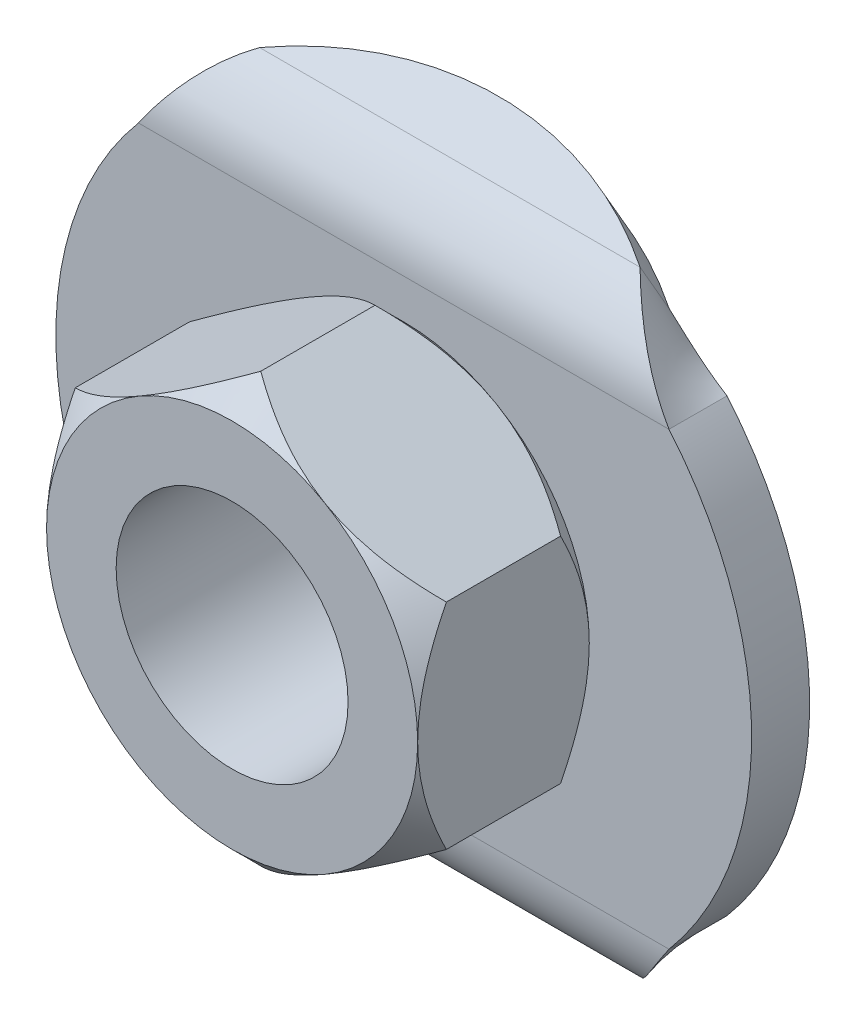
ISO-10303-21;
HEADER;
FILE_DESCRIPTION(('STEP AP214'),'2;1');
FILE_NAME('part.step','',(''),(''),'','','');
FILE_SCHEMA(('AUTOMOTIVE_DESIGN { 1 0 10303 214 1 1 1 1 }'));
ENDSEC;
DATA;
#1=APPLICATION_CONTEXT('core data for automotive mechanical design processes');
#2=APPLICATION_PROTOCOL_DEFINITION('international standard','automotive_design',2000,#1);
#3=PRODUCT_CONTEXT('',#1,'mechanical');
#4=PRODUCT('Part','Part','',(#3));
#5=PRODUCT_RELATED_PRODUCT_CATEGORY('part','',(#4));
#6=PRODUCT_DEFINITION_FORMATION('','',#4);
#7=PRODUCT_DEFINITION_CONTEXT('part definition',#1,'design');
#8=PRODUCT_DEFINITION('design','',#6,#7);
#9=PRODUCT_DEFINITION_SHAPE('','',#8);
#10=(LENGTH_UNIT() NAMED_UNIT(*) SI_UNIT(.MILLI.,.METRE.));
#11=(NAMED_UNIT(*) PLANE_ANGLE_UNIT() SI_UNIT($,.RADIAN.));
#12=(NAMED_UNIT(*) SI_UNIT($,.STERADIAN.) SOLID_ANGLE_UNIT());
#13=UNCERTAINTY_MEASURE_WITH_UNIT(LENGTH_MEASURE(1.E-05),#10,'distance_accuracy_value','');
#14=(GEOMETRIC_REPRESENTATION_CONTEXT(3) GLOBAL_UNCERTAINTY_ASSIGNED_CONTEXT((#13)) GLOBAL_UNIT_ASSIGNED_CONTEXT((#10,
#11,#12)) REPRESENTATION_CONTEXT('',''));
#15=CARTESIAN_POINT('',(0.,0.,0.));
#16=DIRECTION('',(0.,0.,1.));
#17=DIRECTION('',(1.,0.,0.));
#18=AXIS2_PLACEMENT_3D('',#15,#16,#17);
#19=CARTESIAN_POINT('',(0.,0.,4.32748503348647));
#20=DIRECTION('',(0.,0.,-1.));
#21=DIRECTION('',(0.5,0.866025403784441,0.));
#22=AXIS2_PLACEMENT_3D('',#19,#20,#21);
#23=CONICAL_SURFACE('',#22,4.62251496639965,0.785398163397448);
#24=CARTESIAN_POINT('',(3.99999996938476,-2.30940108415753,4.33119782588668));
#25=CARTESIAN_POINT('',(3.99999998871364,-2.22947848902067,4.37115297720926));
#26=CARTESIAN_POINT('',(3.99999999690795,-2.14893787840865,4.40987412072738));
#27=CARTESIAN_POINT('',(4.00000000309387,-1.98649610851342,4.48447130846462));
#28=CARTESIAN_POINT('',(4.00000000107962,-1.90459419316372,4.52034570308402));
#29=CARTESIAN_POINT('',(3.99999999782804,-1.65582081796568,4.62347056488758));
#30=CARTESIAN_POINT('',(3.99999999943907,-1.48682634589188,4.68573980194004));
#31=CARTESIAN_POINT('',(4.00000000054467,-1.14827365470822,4.79145049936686));
#32=CARTESIAN_POINT('',(4.00000000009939,-0.978874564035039,4.83538655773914));
#33=CARTESIAN_POINT('',(3.99999999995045,-0.722069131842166,4.88621630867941));
#34=CARTESIAN_POINT('',(3.99999999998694,-0.63612339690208,4.90063866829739));
#35=CARTESIAN_POINT('',(4.00000000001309,-0.463513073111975,4.92413995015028));
#36=CARTESIAN_POINT('',(4.00000000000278,-0.376848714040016,4.9332205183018));
#37=CARTESIAN_POINT('',(3.99999999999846,-0.241837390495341,4.94298432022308));
#38=CARTESIAN_POINT('',(3.99999999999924,-0.193623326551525,4.94560636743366));
#39=CARTESIAN_POINT('',(4.0000000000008,-0.0969410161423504,4.94911864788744));
#40=CARTESIAN_POINT('',(4.00000000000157,-0.0484725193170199,4.95000198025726));
#41=CARTESIAN_POINT('',(4.,3.60910620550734E-13,4.94999999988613));
#42=B_SPLINE_CURVE_WITH_KNOTS('',3,(#24,#25,#26,#27,#28,#29,#30,#31,#32,#33,#34,#35,#36,#37,#38,
#39,#40,#41),.UNSPECIFIED.,.F.,.F.,(4,2,2,2,2,2,2,2,4),(0.,0.268044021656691,0.536242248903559,
1.07581329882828,1.59970270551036,1.86100635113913,2.12222944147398,2.26705748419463,
2.41245919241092),.UNSPECIFIED.);
#43=CARTESIAN_POINT('',(4.,-2.30940108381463,4.33119784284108));
#44=VERTEX_POINT('',#43);
#45=CARTESIAN_POINT('',(3.99999999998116,0.,4.94999999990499));
#46=VERTEX_POINT('',#45);
#47=EDGE_CURVE('E671',#44,#46,#42,.T.);
#48=ORIENTED_EDGE('',*,*,#47,.T.);
#49=CARTESIAN_POINT('',(0.,0.,4.94999999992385));
#50=DIRECTION('',(0.,0.,-1.));
#51=DIRECTION('',(0.5,0.866025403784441,0.));
#52=AXIS2_PLACEMENT_3D('',#49,#50,#51);
#53=CIRCLE('',#52,3.99999999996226);
#54=CARTESIAN_POINT('',(1.99999999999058,-3.46410161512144,4.94999999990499));
#55=VERTEX_POINT('',#54);
#56=EDGE_CURVE('E277',#55,#46,#53,.F.);
#57=ORIENTED_EDGE('',*,*,#56,.F.);
#58=CARTESIAN_POINT('',(2.00000000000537,-3.46410161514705,4.94999999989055));
#59=CARTESIAN_POINT('',(2.05320487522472,-3.43338376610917,4.9500049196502));
#60=CARTESIAN_POINT('',(2.10640179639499,-3.40267050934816,4.94858391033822));
#61=CARTESIAN_POINT('',(2.21267571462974,-3.34131323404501,4.9429363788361));
#62=CARTESIAN_POINT('',(2.26575272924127,-3.31066920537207,4.93871029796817));
#63=CARTESIAN_POINT('',(2.42446369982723,-3.21903738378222,4.92191541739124));
#64=CARTESIAN_POINT('',(2.52978857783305,-3.15822803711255,4.90522961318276));
#65=CARTESIAN_POINT('',(2.73724458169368,-3.03845325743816,4.86208971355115));
#66=CARTESIAN_POINT('',(2.83939991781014,-2.97947384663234,4.83578673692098));
#67=CARTESIAN_POINT('',(3.04177226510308,-2.86263411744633,4.77455635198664));
#68=CARTESIAN_POINT('',(3.14198865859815,-2.80477415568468,4.73962624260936));
#69=CARTESIAN_POINT('',(3.30588664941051,-2.71014760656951,4.67579548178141));
#70=CARTESIAN_POINT('',(3.37019511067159,-2.67301909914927,4.64899954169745));
#71=CARTESIAN_POINT('',(3.49787015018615,-2.59930588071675,4.59260966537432));
#72=CARTESIAN_POINT('',(3.56123692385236,-2.56272105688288,4.56301631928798));
#73=CARTESIAN_POINT('',(3.68770259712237,-2.48970606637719,4.50102626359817));
#74=CARTESIAN_POINT('',(3.75079195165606,-2.45328141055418,4.46860373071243));
#75=CARTESIAN_POINT('',(3.87606503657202,-2.38095496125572,4.40151316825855));
#76=CARTESIAN_POINT('',(3.93824882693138,-2.3450531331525,4.36684528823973));
#77=CARTESIAN_POINT('',(3.99999993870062,-2.30940111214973,4.33119788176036));
#78=B_SPLINE_CURVE_WITH_KNOTS('',3,(#58,#59,#60,#61,#62,#63,#64,#65,#66,#67,#68,#69,#70,#71,#72,
#73,#74,#75,#76,#77),.UNSPECIFIED.,.F.,.F.,(4,2,2,2,2,2,2,2,2,4),(0.,0.184273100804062,
0.36851721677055,0.736277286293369,1.09849087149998,1.46081800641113,1.69759617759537,
1.93432450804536,2.17350066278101,2.41266090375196),.UNSPECIFIED.);
#79=EDGE_CURVE('E420',#55,#44,#78,.T.);
#80=ORIENTED_EDGE('',*,*,#79,.T.);
#81=EDGE_LOOP('',(#48,#57,#80));
#82=FACE_BOUND('',#81,.T.);
#83=ADVANCED_FACE('F14',(#82),#23,.T.);
#84=CARTESIAN_POINT('',(0.,0.,4.32748503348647));
#85=DIRECTION('',(0.,0.,-1.));
#86=DIRECTION('',(0.5,0.866025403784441,0.));
#87=AXIS2_PLACEMENT_3D('',#84,#85,#86);
#88=CONICAL_SURFACE('',#87,4.62251496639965,0.785398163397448);
#89=CARTESIAN_POINT('',(3.9999999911,2.30940104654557,4.33119782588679));
#90=CARTESIAN_POINT('',(3.93078500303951,2.34936236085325,4.37115297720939));
#91=CARTESIAN_POINT('',(3.86103479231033,2.38963267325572,4.40987412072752));
#92=CARTESIAN_POINT('',(3.7203560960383,2.47085356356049,4.48447130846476));
#93=CARTESIAN_POINT('',(3.64942695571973,2.51180451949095,4.52034570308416));
#94=CARTESIAN_POINT('',(3.43398289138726,2.63619120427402,4.6234705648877));
#95=CARTESIAN_POINT('',(3.28762938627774,2.7206884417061,4.68573980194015));
#96=CARTESIAN_POINT('',(2.99443415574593,2.88996478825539,4.79145049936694));
#97=CARTESIAN_POINT('',(2.84773023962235,2.97466433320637,4.8353865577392));
#98=CARTESIAN_POINT('',(2.62533021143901,3.10306704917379,4.88621630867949));
#99=CARTESIAN_POINT('',(2.55089902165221,3.14603991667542,4.90063866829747));
#100=CARTESIAN_POINT('',(2.40141409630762,3.23234507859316,4.92413995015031));
#101=CARTESIAN_POINT('',(2.32636055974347,3.27567725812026,4.93322051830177));
#102=CARTESIAN_POINT('',(2.20943732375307,3.34318291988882,4.94298432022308));
#103=CARTESIAN_POINT('',(2.16768271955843,3.36728995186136,4.94560636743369));
#104=CARTESIAN_POINT('',(2.08395338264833,3.41563110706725,4.94911864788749));
#105=CARTESIAN_POINT('',(2.04197843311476,3.43986535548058,4.95000198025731));
#106=CARTESIAN_POINT('',(1.99999999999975,3.46410161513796,4.94999999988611));
#107=B_SPLINE_CURVE_WITH_KNOTS('',3,(#89,#90,#91,#92,#93,#94,#95,#96,#97,#98,#99,#100,#101,#102,
#103,#104,#105,#106),.UNSPECIFIED.,.F.,.F.,(4,2,2,2,2,2,2,2,4),(0.,0.2680440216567,
0.536242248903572,1.07581329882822,1.59970270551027,1.86100635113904,2.12222944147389,
2.26705748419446,2.41245919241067),.UNSPECIFIED.);
#108=CARTESIAN_POINT('',(4.0000000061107,2.30940107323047,4.33119784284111));
#109=VERTEX_POINT('',#108);
#110=CARTESIAN_POINT('',(1.99999999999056,3.46410161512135,4.94999999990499));
#111=VERTEX_POINT('',#110);
#112=EDGE_CURVE('E341',#109,#111,#107,.T.);
#113=ORIENTED_EDGE('',*,*,#112,.T.);
#114=CARTESIAN_POINT('',(0.,0.,4.94999999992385));
#115=DIRECTION('',(0.,0.,-1.));
#116=DIRECTION('',(0.5,0.866025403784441,0.));
#117=AXIS2_PLACEMENT_3D('',#114,#115,#116);
#118=CIRCLE('',#117,3.99999999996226);
#119=EDGE_CURVE('E274',#46,#111,#118,.F.);
#120=ORIENTED_EDGE('',*,*,#119,.F.);
#121=CARTESIAN_POINT('',(4.00000000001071,0.,4.94999999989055));
#122=CARTESIAN_POINT('',(4.00000000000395,0.0614356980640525,4.95000491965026));
#123=CARTESIAN_POINT('',(4.00000000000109,0.122862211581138,4.9485839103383));
#124=CARTESIAN_POINT('',(3.99999999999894,0.245576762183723,4.9429363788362));
#125=CARTESIAN_POINT('',(3.99999999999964,0.306864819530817,4.93871029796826));
#126=CARTESIAN_POINT('',(4.00000000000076,0.490128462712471,4.92191541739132));
#127=CARTESIAN_POINT('',(4.00000000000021,0.611747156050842,4.90522961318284));
#128=CARTESIAN_POINT('',(3.99999999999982,0.851296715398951,4.86208971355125));
#129=CARTESIAN_POINT('',(3.99999999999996,0.969255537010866,4.83578673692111));
#130=CARTESIAN_POINT('',(4.00000000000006,1.20293499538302,4.7745563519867));
#131=CARTESIAN_POINT('',(4.00000000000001,1.31865491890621,4.73962624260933));
#132=CARTESIAN_POINT('',(3.99999999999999,1.50790801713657,4.67579548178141));
#133=CARTESIAN_POINT('',(4.00000000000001,1.5821650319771,4.6489995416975));
#134=CARTESIAN_POINT('',(4.00000000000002,1.72959146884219,4.59260966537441));
#135=CARTESIAN_POINT('',(4.00000000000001,1.80276111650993,4.56301631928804));
#136=CARTESIAN_POINT('',(4.00000000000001,1.94879109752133,4.5010262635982));
#137=CARTESIAN_POINT('',(4.00000000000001,2.02164040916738,4.46860373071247));
#138=CARTESIAN_POINT('',(4.00000000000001,2.1662933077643,4.40151316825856));
#139=CARTESIAN_POINT('',(4.00000000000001,2.23809696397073,4.36684528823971));
#140=CARTESIAN_POINT('',(4.,2.30940100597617,4.33119788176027));
#141=B_SPLINE_CURVE_WITH_KNOTS('',3,(#121,#122,#123,#124,#125,#126,#127,#128,#129,#130,#131,
#132,#133,#134,#135,#136,#137,#138,#139,#140),.UNSPECIFIED.,.F.,.F.,(4,2,2,2,2,2,2,2,2,4),(0.,
0.184273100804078,0.368517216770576,0.736277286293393,1.09849087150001,1.46081800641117,
1.69759617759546,1.93432450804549,2.17350066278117,2.41266090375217),.UNSPECIFIED.);
#142=EDGE_CURVE('E674',#46,#109,#141,.T.);
#143=ORIENTED_EDGE('',*,*,#142,.T.);
#144=EDGE_LOOP('',(#113,#120,#143));
#145=FACE_BOUND('',#144,.T.);
#146=ADVANCED_FACE('F322',(#145),#88,.T.);
#147=CARTESIAN_POINT('',(0.,0.,4.32748503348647));
#148=DIRECTION('',(0.,0.,-1.));
#149=DIRECTION('',(0.5,0.866025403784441,0.));
#150=AXIS2_PLACEMENT_3D('',#147,#148,#149);
#151=CONICAL_SURFACE('',#150,4.62251496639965,0.785398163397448);
#152=CARTESIAN_POINT('',(2.17146399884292E-08,4.61880213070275,4.33119782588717));
#153=CARTESIAN_POINT('',(-0.0692149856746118,4.57884084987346,4.37115297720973));
#154=CARTESIAN_POINT('',(-0.138965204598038,4.53857055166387,4.40987412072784));
#155=CARTESIAN_POINT('',(-0.279643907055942,4.45734967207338,4.48447130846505));
#156=CARTESIAN_POINT('',(-0.350573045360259,4.41639871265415,4.52034570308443));
#157=CARTESIAN_POINT('',(-0.566017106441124,4.29201202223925,4.62347056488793));
#158=CARTESIAN_POINT('',(-0.712370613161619,4.20751478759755,4.68573980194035));
#159=CARTESIAN_POINT('',(-1.00556584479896,4.03823844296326,4.79145049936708));
#160=CARTESIAN_POINT('',(-1.15226976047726,3.95353889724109,4.83538655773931));
#161=CARTESIAN_POINT('',(-1.37466978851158,3.82513618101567,4.88621630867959));
#162=CARTESIAN_POINT('',(-1.44910097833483,3.78216331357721,4.90063866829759));
#163=CARTESIAN_POINT('',(-1.59858590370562,3.69585815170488,4.92413995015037));
#164=CARTESIAN_POINT('',(-1.67363944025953,3.65252597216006,4.93322051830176));
#165=CARTESIAN_POINT('',(-1.79056267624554,3.58502031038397,4.94298432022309));
#166=CARTESIAN_POINT('',(-1.83231728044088,3.56091327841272,4.94560636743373));
#167=CARTESIAN_POINT('',(-1.91604661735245,3.51257212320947,4.94911864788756));
#168=CARTESIAN_POINT('',(-1.95802156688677,3.4883378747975,4.95000198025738));
#169=CARTESIAN_POINT('',(-2.00000000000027,3.46410161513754,4.94999999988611));
#170=B_SPLINE_CURVE_WITH_KNOTS('',3,(#152,#153,#154,#155,#156,#157,#158,#159,#160,#161,#162,
#163,#164,#165,#166,#167,#168,#169),.UNSPECIFIED.,.F.,.F.,(4,2,2,2,2,2,2,2,4),(0.,
0.26804402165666,0.536242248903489,1.07581329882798,1.59970270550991,1.86100635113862,
2.12222944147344,2.26705748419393,2.41245919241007),.UNSPECIFIED.);
#171=CARTESIAN_POINT('',(6.11044149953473E-09,4.61880215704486,4.33119784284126));
#172=VERTEX_POINT('',#171);
#173=CARTESIAN_POINT('',(-1.99999999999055,3.46410161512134,4.94999999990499));
#174=VERTEX_POINT('',#173);
#175=EDGE_CURVE('E327',#172,#174,#170,.T.);
#176=ORIENTED_EDGE('',*,*,#175,.T.);
#177=CARTESIAN_POINT('',(0.,0.,4.94999999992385));
#178=DIRECTION('',(0.,0.,-1.));
#179=DIRECTION('',(0.5,0.866025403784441,0.));
#180=AXIS2_PLACEMENT_3D('',#177,#178,#179);
#181=CIRCLE('',#180,3.99999999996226);
#182=EDGE_CURVE('E271',#111,#174,#181,.F.);
#183=ORIENTED_EDGE('',*,*,#182,.F.);
#184=CARTESIAN_POINT('',(2.00000000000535,3.46410161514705,4.94999999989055));
#185=CARTESIAN_POINT('',(1.94679512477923,3.49481946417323,4.95000491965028));
#186=CARTESIAN_POINT('',(1.89359820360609,3.52553272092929,4.94858391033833));
#187=CARTESIAN_POINT('',(1.78732428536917,3.58688999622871,4.94293637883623));
#188=CARTESIAN_POINT('',(1.73424727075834,3.61753402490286,4.93871029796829));
#189=CARTESIAN_POINT('',(1.57553630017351,3.70916584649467,4.92191541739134));
#190=CARTESIAN_POINT('',(1.47021142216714,3.76997519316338,4.90522961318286));
#191=CARTESIAN_POINT('',(1.2627554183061,3.88974997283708,4.86208971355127));
#192=CARTESIAN_POINT('',(1.16060008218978,3.94872938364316,4.83578673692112));
#193=CARTESIAN_POINT('',(0.958227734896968,4.06556911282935,4.7745563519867));
#194=CARTESIAN_POINT('',(0.858011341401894,4.12342907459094,4.73962624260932));
#195=CARTESIAN_POINT('',(0.694113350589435,4.21805562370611,4.67579548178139));
#196=CARTESIAN_POINT('',(0.629804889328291,4.25518413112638,4.64899954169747));
#197=CARTESIAN_POINT('',(0.502129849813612,4.32889734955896,4.59260966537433));
#198=CARTESIAN_POINT('',(0.438763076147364,4.36548217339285,4.56301631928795));
#199=CARTESIAN_POINT('',(0.312297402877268,4.43849716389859,4.50102626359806));
#200=CARTESIAN_POINT('',(0.249208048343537,4.47492181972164,4.46860373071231));
#201=CARTESIAN_POINT('',(0.123934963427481,4.54724826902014,4.40151316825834));
#202=CARTESIAN_POINT('',(0.0617511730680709,4.58315009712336,4.36684528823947));
#203=CARTESIAN_POINT('',(6.12988005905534E-08,4.6188021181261,4.33119788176));
#204=B_SPLINE_CURVE_WITH_KNOTS('',3,(#184,#185,#186,#187,#188,#189,#190,#191,#192,#193,#194,
#195,#196,#197,#198,#199,#200,#201,#202,#203),.UNSPECIFIED.,.F.,.F.,(4,2,2,2,2,2,2,2,2,4),(0.,
0.184273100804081,0.368517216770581,0.736277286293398,1.09849087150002,1.46081800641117,
1.69759617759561,1.93432450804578,2.1735006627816,2.41266090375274),.UNSPECIFIED.);
#205=EDGE_CURVE('E333',#111,#172,#204,.T.);
#206=ORIENTED_EDGE('',*,*,#205,.T.);
#207=EDGE_LOOP('',(#176,#183,#206));
#208=FACE_BOUND('',#207,.T.);
#209=ADVANCED_FACE('F314',(#208),#151,.T.);
#210=CARTESIAN_POINT('',(0.,0.,4.32748503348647));
#211=DIRECTION('',(0.,0.,-1.));
#212=DIRECTION('',(0.5,0.866025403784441,0.));
#213=AXIS2_PLACEMENT_3D('',#210,#211,#212);
#214=CONICAL_SURFACE('',#213,4.62251496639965,0.785398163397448);
#215=CARTESIAN_POINT('',(0.,0.,4.94999999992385));
#216=DIRECTION('',(0.,0.,-1.));
#217=DIRECTION('',(0.5,0.866025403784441,0.));
#218=AXIS2_PLACEMENT_3D('',#215,#216,#217);
#219=CIRCLE('',#218,3.99999999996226);
#220=CARTESIAN_POINT('',(-3.99999999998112,0.,4.94999999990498));
#221=VERTEX_POINT('',#220);
#222=EDGE_CURVE('E244',#174,#221,#219,.F.);
#223=ORIENTED_EDGE('',*,*,#222,.F.);
#224=CARTESIAN_POINT('',(-2.00000000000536,3.46410161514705,4.94999999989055));
#225=CARTESIAN_POINT('',(-2.05320487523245,3.43338376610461,4.95000491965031));
#226=CARTESIAN_POINT('',(-2.1064017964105,3.40267050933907,4.94858391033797));
#227=CARTESIAN_POINT('',(-2.21267571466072,3.34131323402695,4.94293637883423));
#228=CARTESIAN_POINT('',(-2.26575272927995,3.31066920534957,4.93871029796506));
#229=CARTESIAN_POINT('',(-2.4244636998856,3.21903738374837,4.9219154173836));
#230=CARTESIAN_POINT('',(-2.52978857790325,3.15822803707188,4.90522961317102));
#231=CARTESIAN_POINT('',(-2.73724458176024,3.03845325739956,4.86208971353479));
#232=CARTESIAN_POINT('',(-2.83939991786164,2.97947384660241,4.83578673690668));
#233=CARTESIAN_POINT('',(-3.04177226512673,2.86263411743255,4.77455635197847));
#234=CARTESIAN_POINT('',(-3.14198865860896,2.80477415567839,4.73962624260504));
#235=CARTESIAN_POINT('',(-3.30588665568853,2.71014760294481,4.67579547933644));
#236=CARTESIAN_POINT('',(-3.37019512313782,2.67301909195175,4.64899953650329));
#237=CARTESIAN_POINT('',(-3.49787017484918,2.59930586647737,4.5926096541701));
#238=CARTESIAN_POINT('',(-3.56123695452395,2.56272103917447,4.56301630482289));
#239=CARTESIAN_POINT('',(-3.68770263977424,2.48970604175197,4.50102624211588));
#240=CARTESIAN_POINT('',(-3.75079200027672,2.45328138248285,4.46860370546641));
#241=CARTESIAN_POINT('',(-3.87606509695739,2.38095492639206,4.40151313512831));
#242=CARTESIAN_POINT('',(-3.93824889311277,2.34505309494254,4.36684525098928));
#243=CARTESIAN_POINT('',(-4.00000001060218,2.30940107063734,4.33119784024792));
#244=B_SPLINE_CURVE_WITH_KNOTS('',3,(#224,#225,#226,#227,#228,#229,#230,#231,#232,#233,#234,
#235,#236,#237,#238,#239,#240,#241,#242,#243),.UNSPECIFIED.,.F.,.F.,(4,2,2,2,2,2,2,2,2,4),(0.,
0.184273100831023,0.368517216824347,0.736277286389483,1.09849087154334,1.46081800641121,
1.69759620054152,1.93432455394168,2.17350073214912,2.41266099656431),.UNSPECIFIED.);
#245=CARTESIAN_POINT('',(-4.,2.30940104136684,4.33119786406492));
#246=VERTEX_POINT('',#245);
#247=EDGE_CURVE('E289',#174,#246,#244,.T.);
#248=ORIENTED_EDGE('',*,*,#247,.T.);
#249=CARTESIAN_POINT('',(-4.0000000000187,2.30940100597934,4.33119788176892));
#250=CARTESIAN_POINT('',(-4.00000000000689,2.22947840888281,4.37115302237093));
#251=CARTESIAN_POINT('',(-4.00000000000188,2.14893779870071,4.40987416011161));
#252=CARTESIAN_POINT('',(-3.9999999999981,1.98649603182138,4.48447134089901));
#253=CARTESIAN_POINT('',(-3.99999999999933,1.90459411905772,4.52034573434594));
#254=CARTESIAN_POINT('',(-4.00000000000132,1.65582075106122,4.62347059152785));
#255=CARTESIAN_POINT('',(-4.00000000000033,1.48682628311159,4.68573982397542));
#256=CARTESIAN_POINT('',(-3.99999999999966,1.1482736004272,4.79145051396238));
#257=CARTESIAN_POINT('',(-3.99999999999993,0.978874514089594,4.83538656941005));
#258=CARTESIAN_POINT('',(-4.00000000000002,0.722069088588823,4.88621631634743));
#259=CARTESIAN_POINT('',(-3.99999999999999,0.636123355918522,4.9006386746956));
#260=CARTESIAN_POINT('',(-3.99999999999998,0.463513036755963,4.92413995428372));
#261=CARTESIAN_POINT('',(-4.,0.376848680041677,4.93322052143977));
#262=CARTESIAN_POINT('',(-4.,0.241837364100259,4.9429843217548));
#263=CARTESIAN_POINT('',(-3.99999999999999,0.193623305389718,4.94560636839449));
#264=CARTESIAN_POINT('',(-3.99999999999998,0.0969410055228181,4.94911864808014));
#265=CARTESIAN_POINT('',(-3.99999999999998,0.0484725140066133,4.95000198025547));
#266=CARTESIAN_POINT('',(-4.,-3.60910620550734E-13,4.94999999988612));
#267=B_SPLINE_CURVE_WITH_KNOTS('',3,(#249,#250,#251,#252,#253,#254,#255,#256,#257,#258,#259,
#260,#261,#262,#263,#264,#265,#266),.UNSPECIFIED.,.F.,.F.,(4,2,2,2,2,2,2,2,4),(0.,
0.268044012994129,0.536242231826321,1.07581326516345,1.59970265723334,1.86100629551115,
2.122229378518,2.26705740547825,2.4124590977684),.UNSPECIFIED.);
#268=EDGE_CURVE('E298',#246,#221,#267,.T.);
#269=ORIENTED_EDGE('',*,*,#268,.T.);
#270=EDGE_LOOP('',(#223,#248,#269));
#271=FACE_BOUND('',#270,.T.);
#272=ADVANCED_FACE('F308',(#271),#214,.T.);
#273=CARTESIAN_POINT('',(0.,0.,4.32748503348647));
#274=DIRECTION('',(0.,0.,-1.));
#275=DIRECTION('',(0.5,0.866025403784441,0.));
#276=AXIS2_PLACEMENT_3D('',#273,#274,#275);
#277=CONICAL_SURFACE('',#276,4.62251496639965,0.785398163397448);
#278=CARTESIAN_POINT('',(-3.99999999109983,-2.30940104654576,4.33119782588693));
#279=CARTESIAN_POINT('',(-3.9307850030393,-2.3493623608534,4.37115297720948));
#280=CARTESIAN_POINT('',(-3.86103479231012,-2.38963267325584,4.40987412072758));
#281=CARTESIAN_POINT('',(-3.7203560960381,-2.47085356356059,4.48447130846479));
#282=CARTESIAN_POINT('',(-3.64942695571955,-2.51180451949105,4.52034570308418));
#283=CARTESIAN_POINT('',(-3.43398289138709,-2.63619120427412,4.62347056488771));
#284=CARTESIAN_POINT('',(-3.28762938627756,-2.72068844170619,4.68573980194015));
#285=CARTESIAN_POINT('',(-2.99443415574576,-2.88996478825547,4.79145049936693));
#286=CARTESIAN_POINT('',(-2.84773023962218,-2.97466433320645,4.83538655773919));
#287=CARTESIAN_POINT('',(-2.62533021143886,-3.10306704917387,4.88621630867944));
#288=CARTESIAN_POINT('',(-2.55089902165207,-3.1460399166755,4.9006386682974));
#289=CARTESIAN_POINT('',(-2.40141409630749,-3.23234507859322,4.92413995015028));
#290=CARTESIAN_POINT('',(-2.32636055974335,-3.2756772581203,4.9332205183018));
#291=CARTESIAN_POINT('',(-2.20943732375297,-3.34318291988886,4.94298432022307));
#292=CARTESIAN_POINT('',(-2.16768271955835,-3.3672899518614,4.94560636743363));
#293=CARTESIAN_POINT('',(-2.08395338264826,-3.41563110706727,4.9491186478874));
#294=CARTESIAN_POINT('',(-2.04197843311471,-3.4398653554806,4.95000198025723));
#295=CARTESIAN_POINT('',(-1.9999999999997,-3.46410161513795,4.94999999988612));
#296=B_SPLINE_CURVE_WITH_KNOTS('',3,(#278,#279,#280,#281,#282,#283,#284,#285,#286,#287,#288,
#289,#290,#291,#292,#293,#294,#295),.UNSPECIFIED.,.F.,.F.,(4,2,2,2,2,2,2,2,4),(0.,
0.268044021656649,0.536242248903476,1.07581329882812,1.59970270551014,1.86100635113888,
2.1222294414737,2.26705748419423,2.4124591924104),.UNSPECIFIED.);
#297=CARTESIAN_POINT('',(-4.00000000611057,-2.30940107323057,4.33119784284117));
#298=VERTEX_POINT('',#297);
#299=CARTESIAN_POINT('',(-1.99999999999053,-3.46410161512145,4.94999999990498));
#300=VERTEX_POINT('',#299);
#301=EDGE_CURVE('E452',#298,#300,#296,.T.);
#302=ORIENTED_EDGE('',*,*,#301,.T.);
#303=CARTESIAN_POINT('',(0.,0.,4.94999999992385));
#304=DIRECTION('',(0.,0.,-1.));
#305=DIRECTION('',(0.5,0.866025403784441,0.));
#306=AXIS2_PLACEMENT_3D('',#303,#304,#305);
#307=CIRCLE('',#306,3.99999999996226);
#308=EDGE_CURVE('E283',#221,#300,#307,.F.);
#309=ORIENTED_EDGE('',*,*,#308,.F.);
#310=CARTESIAN_POINT('',(-4.00000000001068,0.,4.94999999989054));
#311=CARTESIAN_POINT('',(-4.00000000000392,-0.0614356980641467,4.95000491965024));
#312=CARTESIAN_POINT('',(-4.00000000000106,-0.122862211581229,4.94858391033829));
#313=CARTESIAN_POINT('',(-3.99999999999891,-0.245576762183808,4.94293637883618));
#314=CARTESIAN_POINT('',(-3.99999999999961,-0.306864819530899,4.93871029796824));
#315=CARTESIAN_POINT('',(-4.00000000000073,-0.490128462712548,4.92191541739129));
#316=CARTESIAN_POINT('',(-4.00000000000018,-0.611747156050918,4.90522961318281));
#317=CARTESIAN_POINT('',(-3.99999999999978,-0.851296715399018,4.86208971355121));
#318=CARTESIAN_POINT('',(-3.99999999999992,-0.969255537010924,4.83578673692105));
#319=CARTESIAN_POINT('',(-4.00000000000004,-1.20293499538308,4.77455635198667));
#320=CARTESIAN_POINT('',(-4.00000000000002,-1.31865491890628,4.73962624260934));
#321=CARTESIAN_POINT('',(-3.99999999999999,-1.50790801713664,4.6757954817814));
#322=CARTESIAN_POINT('',(-3.99999999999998,-1.58216503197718,4.64899954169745));
#323=CARTESIAN_POINT('',(-3.99999999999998,-1.72959146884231,4.59260966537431));
#324=CARTESIAN_POINT('',(-3.99999999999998,-1.80276111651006,4.56301631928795));
#325=CARTESIAN_POINT('',(-3.99999999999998,-1.9487910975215,4.50102626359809));
#326=CARTESIAN_POINT('',(-3.99999999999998,-2.02164040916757,4.46860373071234));
#327=CARTESIAN_POINT('',(-3.99999999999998,-2.16629330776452,4.40151316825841));
#328=CARTESIAN_POINT('',(-3.99999999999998,-2.23809696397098,4.36684528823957));
#329=CARTESIAN_POINT('',(-4.,-2.30940100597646,4.33119788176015));
#330=B_SPLINE_CURVE_WITH_KNOTS('',3,(#310,#311,#312,#313,#314,#315,#316,#317,#318,#319,#320,
#321,#322,#323,#324,#325,#326,#327,#328,#329),.UNSPECIFIED.,.F.,.F.,(4,2,2,2,2,2,2,2,2,4),(0.,
0.184273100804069,0.368517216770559,0.736277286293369,1.09849087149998,1.46081800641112,
1.69759617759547,1.93432450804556,2.17350066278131,2.41266090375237),.UNSPECIFIED.);
#331=EDGE_CURVE('E247',#221,#298,#330,.T.);
#332=ORIENTED_EDGE('',*,*,#331,.T.);
#333=EDGE_LOOP('',(#302,#309,#332));
#334=FACE_BOUND('',#333,.T.);
#335=ADVANCED_FACE('F313',(#334),#277,.T.);
#336=CARTESIAN_POINT('',(0.,0.,4.32748503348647));
#337=DIRECTION('',(0.,0.,-1.));
#338=DIRECTION('',(0.5,0.866025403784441,0.));
#339=AXIS2_PLACEMENT_3D('',#336,#337,#338);
#340=CONICAL_SURFACE('',#339,4.62251496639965,0.785398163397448);
#341=CARTESIAN_POINT('',(-2.17141872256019E-08,-4.61880213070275,4.33119782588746));
#342=CARTESIAN_POINT('',(0.0692149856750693,-4.5788408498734,4.37115297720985));
#343=CARTESIAN_POINT('',(0.13896520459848,-4.53857055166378,4.40987412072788));
#344=CARTESIAN_POINT('',(0.279643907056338,-4.4573496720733,4.484471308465));
#345=CARTESIAN_POINT('',(0.350573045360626,-4.4163987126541,4.52034570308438));
#346=CARTESIAN_POINT('',(0.566017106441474,-4.29201202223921,4.62347056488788));
#347=CARTESIAN_POINT('',(0.71237061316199,-4.20751478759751,4.68573980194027));
#348=CARTESIAN_POINT('',(1.00556584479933,-4.03823844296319,4.791450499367));
#349=CARTESIAN_POINT('',(1.15226976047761,-3.95353889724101,4.83538655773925));
#350=CARTESIAN_POINT('',(1.37466978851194,-3.82513618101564,4.88621630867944));
#351=CARTESIAN_POINT('',(1.44910097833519,-3.78216331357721,4.90063866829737));
#352=CARTESIAN_POINT('',(1.59858590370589,-3.69585815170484,4.92413995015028));
#353=CARTESIAN_POINT('',(1.67363944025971,-3.65252597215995,4.93322051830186));
#354=CARTESIAN_POINT('',(1.79056267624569,-3.58502031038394,4.94298432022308));
#355=CARTESIAN_POINT('',(1.83231728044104,-3.56091327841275,4.9456063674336));
#356=CARTESIAN_POINT('',(1.91604661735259,-3.51257212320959,4.94911864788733));
#357=CARTESIAN_POINT('',(1.95802156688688,-3.48833787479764,4.95000198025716));
#358=CARTESIAN_POINT('',(2.00000000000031,-3.46410161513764,4.94999999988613));
#359=B_SPLINE_CURVE_WITH_KNOTS('',3,(#341,#342,#343,#344,#345,#346,#347,#348,#349,#350,#351,
#352,#353,#354,#355,#356,#357,#358),.UNSPECIFIED.,.F.,.F.,(4,2,2,2,2,2,2,2,4),(0.,
0.268044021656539,0.536242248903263,1.07581329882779,1.59970270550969,1.86100635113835,
2.12222944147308,2.26705748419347,2.4124591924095),.UNSPECIFIED.);
#360=CARTESIAN_POINT('',(-6.11020731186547E-09,-4.61880215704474,4.33119784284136));
#361=VERTEX_POINT('',#360);
#362=EDGE_CURVE('E428',#361,#55,#359,.T.);
#363=ORIENTED_EDGE('',*,*,#362,.T.);
#364=CARTESIAN_POINT('',(0.,0.,4.94999999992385));
#365=DIRECTION('',(0.,0.,-1.));
#366=DIRECTION('',(0.5,0.866025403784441,0.));
#367=AXIS2_PLACEMENT_3D('',#364,#365,#366);
#368=CIRCLE('',#367,3.99999999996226);
#369=EDGE_CURVE('E280',#300,#55,#368,.F.);
#370=ORIENTED_EDGE('',*,*,#369,.F.);
#371=CARTESIAN_POINT('',(-2.00000000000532,-3.46410161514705,4.94999999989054));
#372=CARTESIAN_POINT('',(-1.9467951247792,-3.49481946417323,4.95000491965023));
#373=CARTESIAN_POINT('',(-1.89359820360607,-3.52553272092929,4.94858391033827));
#374=CARTESIAN_POINT('',(-1.78732428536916,-3.5868899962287,4.94293637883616));
#375=CARTESIAN_POINT('',(-1.73424727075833,-3.61753402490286,4.93871029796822));
#376=CARTESIAN_POINT('',(-1.5755363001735,-3.70916584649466,4.92191541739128));
#377=CARTESIAN_POINT('',(-1.47021142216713,-3.76997519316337,4.9052296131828));
#378=CARTESIAN_POINT('',(-1.2627554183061,-3.88974997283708,4.86208971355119));
#379=CARTESIAN_POINT('',(-1.16060008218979,-3.94872938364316,4.83578673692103));
#380=CARTESIAN_POINT('',(-0.958227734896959,-4.06556911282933,4.77455635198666));
#381=CARTESIAN_POINT('',(-0.858011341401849,-4.12342907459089,4.73962624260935));
#382=CARTESIAN_POINT('',(-0.694113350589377,-4.21805562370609,4.67579548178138));
#383=CARTESIAN_POINT('',(-0.629804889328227,-4.25518413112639,4.6489995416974));
#384=CARTESIAN_POINT('',(-0.5021298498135,-4.32889734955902,4.5926096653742));
#385=CARTESIAN_POINT('',(-0.438763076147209,-4.36548217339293,4.56301631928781));
#386=CARTESIAN_POINT('',(-0.312297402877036,-4.43849716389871,4.50102626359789));
#387=CARTESIAN_POINT('',(-0.249208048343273,-4.47492181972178,4.46860373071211));
#388=CARTESIAN_POINT('',(-0.123934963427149,-4.54724826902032,4.40151316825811));
#389=CARTESIAN_POINT('',(-0.0617511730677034,-4.58315009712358,4.36684528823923));
#390=CARTESIAN_POINT('',(-6.12983859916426E-08,-4.61880211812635,4.33119788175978));
#391=B_SPLINE_CURVE_WITH_KNOTS('',3,(#371,#372,#373,#374,#375,#376,#377,#378,#379,#380,#381,
#382,#383,#384,#385,#386,#387,#388,#389,#390),.UNSPECIFIED.,.F.,.F.,(4,2,2,2,2,2,2,2,2,4),(0.,
0.184273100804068,0.368517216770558,0.736277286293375,1.09849087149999,1.46081800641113,
1.69759617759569,1.93432450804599,2.17350066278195,2.41266090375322),.UNSPECIFIED.);
#392=EDGE_CURVE('E436',#300,#361,#391,.T.);
#393=ORIENTED_EDGE('',*,*,#392,.T.);
#394=EDGE_LOOP('',(#363,#370,#393));
#395=FACE_BOUND('',#394,.T.);
#396=ADVANCED_FACE('F442',(#395),#340,.T.);
#397=CARTESIAN_POINT('',(-6.1770603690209,1.05247468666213,4.95));
#398=DIRECTION('',(0.5,-0.866025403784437,0.));
#399=DIRECTION('',(0.866025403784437,0.5,0.));
#400=AXIS2_PLACEMENT_3D('',#397,#398,#399);
#401=PLANE('',#400);
#402=DIRECTION('',(0.,0.,1.));
#403=VECTOR('',#402,1.);
#404=CARTESIAN_POINT('',(0.,4.618802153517,4.95));
#405=LINE('',#404,#403);
#406=CARTESIAN_POINT('',(0.,4.61880215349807,1.86880215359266));
#407=VERTEX_POINT('',#406);
#408=EDGE_CURVE('E245',#407,#172,#405,.T.);
#409=ORIENTED_EDGE('',*,*,#408,.F.);
#410=CARTESIAN_POINT('',(-2.00000000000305,3.46410161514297,1.25000000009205));
#411=CARTESIAN_POINT('',(-1.94679512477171,3.49481946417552,1.2499950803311));
#412=CARTESIAN_POINT('',(-1.89359820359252,3.5255327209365,1.25141608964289));
#413=CARTESIAN_POINT('',(-1.78732428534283,3.58688999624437,1.25706362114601));
#414=CARTESIAN_POINT('',(-1.73424727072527,3.61753402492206,1.26128970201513));
#415=CARTESIAN_POINT('',(-1.57553630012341,3.70916584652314,1.27808458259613));
#416=CARTESIAN_POINT('',(-1.47021142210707,3.76997519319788,1.29477038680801));
#417=CARTESIAN_POINT('',(-1.26275541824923,3.88974997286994,1.33791028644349));
#418=CARTESIAN_POINT('',(-1.16060008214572,3.94872938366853,1.36421326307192));
#419=CARTESIAN_POINT('',(-0.958227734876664,4.06556911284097,1.42544364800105));
#420=CARTESIAN_POINT('',(-0.858011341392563,4.12342907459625,1.46037375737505));
#421=CARTESIAN_POINT('',(-0.694113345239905,4.2180556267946,1.52420452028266));
#422=CARTESIAN_POINT('',(-0.629804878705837,4.25518413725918,1.5510004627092));
#423=CARTESIAN_POINT('',(-0.502129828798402,4.32889736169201,1.60739034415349));
#424=CARTESIAN_POINT('',(-0.438763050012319,4.36548218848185,1.63698369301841));
#425=CARTESIAN_POINT('',(-0.312297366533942,4.43849718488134,1.69897375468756));
#426=CARTESIAN_POINT('',(-0.249208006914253,4.47492184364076,1.73139629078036));
#427=CARTESIAN_POINT('',(-0.123934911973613,4.54724829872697,1.79848685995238));
#428=CARTESIAN_POINT('',(-0.0617511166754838,4.58315012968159,1.83315474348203));
#429=CARTESIAN_POINT('',(-3.21380010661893E-11,4.61880215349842,1.86880215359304));
#430=B_SPLINE_CURVE_WITH_KNOTS('',3,(#410,#411,#412,#413,#414,#415,#416,#417,#418,#419,#420,
#421,#422,#423,#424,#425,#426,#427,#428,#429),.UNSPECIFIED.,.F.,.F.,(4,2,2,2,2,2,2,2,2,4),(0.,
0.184273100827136,0.368517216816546,0.73627728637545,1.09849087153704,1.46081800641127,
1.6975961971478,1.93432454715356,2.17350072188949,2.41266098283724),.UNSPECIFIED.);
#431=CARTESIAN_POINT('',(-2.,3.46410161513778,1.25));
#432=VERTEX_POINT('',#431);
#433=EDGE_CURVE('E248',#432,#407,#430,.T.);
#434=ORIENTED_EDGE('',*,*,#433,.F.);
#435=CARTESIAN_POINT('',(-3.99999999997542,2.30940107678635,1.86880215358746));
#436=CARTESIAN_POINT('',(-3.93078499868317,2.34936237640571,1.82884701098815));
#437=CARTESIAN_POINT('',(-3.86103478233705,2.3896326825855,1.79012587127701));
#438=CARTESIAN_POINT('',(-3.72035608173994,2.47085356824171,1.71552868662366));
#439=CARTESIAN_POINT('',(-3.64942694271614,2.5118045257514,1.67965429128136));
#440=CARTESIAN_POINT('',(-3.43398288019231,2.6361912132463,1.57652942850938));
#441=CARTESIAN_POINT('',(-3.28762937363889,2.72068844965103,1.51426019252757));
#442=CARTESIAN_POINT('',(-2.99443414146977,2.8899647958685,1.40854949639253));
#443=CARTESIAN_POINT('',(-2.8477302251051,2.97466434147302,1.36461343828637));
#444=CARTESIAN_POINT('',(-2.62533019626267,3.10306705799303,1.3137836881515));
#445=CARTESIAN_POINT('',(-2.55089900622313,3.14603992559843,1.29936132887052));
#446=CARTESIAN_POINT('',(-2.40141408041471,3.23234508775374,1.27586004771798));
#447=CARTESIAN_POINT('',(-2.32636054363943,3.27567726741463,1.26677947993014));
#448=CARTESIAN_POINT('',(-2.20943731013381,3.3431829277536,1.25701567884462));
#449=CARTESIAN_POINT('',(-2.16768270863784,3.36728995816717,1.25439363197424));
#450=CARTESIAN_POINT('',(-2.08395337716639,3.41563111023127,1.25088135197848));
#451=CARTESIAN_POINT('',(-2.04197843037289,3.43986535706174,1.24999801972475));
#452=CARTESIAN_POINT('',(-1.99999999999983,3.46410161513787,1.25000000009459));
#453=B_SPLINE_CURVE_WITH_KNOTS('',3,(#435,#436,#437,#438,#439,#440,#441,#442,#443,#444,#445,
#446,#447,#448,#449,#450,#451,#452),.UNSPECIFIED.,.F.,.F.,(4,2,2,2,2,2,2,2,4),(0.,
0.26804402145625,0.536242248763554,1.07581329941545,1.59970270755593,1.86100635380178,
2.1222294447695,2.26705747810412,2.41245917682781),.UNSPECIFIED.);
#454=CARTESIAN_POINT('',(-4.,2.30940107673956,1.86880215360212));
#455=VERTEX_POINT('',#454);
#456=EDGE_CURVE('E252',#455,#432,#453,.T.);
#457=ORIENTED_EDGE('',*,*,#456,.F.);
#458=DIRECTION('',(0.,0.,1.));
#459=VECTOR('',#458,1.);
#460=CARTESIAN_POINT('',(-4.,2.30940107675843,4.95));
#461=LINE('',#460,#459);
#462=EDGE_CURVE('E249',#246,#455,#461,.F.);
#463=ORIENTED_EDGE('',*,*,#462,.F.);
#464=ORIENTED_EDGE('',*,*,#247,.F.);
#465=ORIENTED_EDGE('',*,*,#175,.F.);
#466=EDGE_LOOP('',(#409,#434,#457,#463,#464,#465));
#467=FACE_BOUND('',#466,.T.);
#468=ADVANCED_FACE('F305',(#467),#401,.F.);
#469=CARTESIAN_POINT('',(-4.,4.82325385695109,4.95));
#470=DIRECTION('',(1.,0.,0.));
#471=DIRECTION('',(0.,1.,0.));
#472=AXIS2_PLACEMENT_3D('',#469,#470,#471);
#473=PLANE('',#472);
#474=ORIENTED_EDGE('',*,*,#462,.T.);
#475=CARTESIAN_POINT('',(-4.00000000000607,0.,1.25000000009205));
#476=CARTESIAN_POINT('',(-4.00000000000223,0.0614356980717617,1.24999508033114));
#477=CARTESIAN_POINT('',(-4.0000000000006,0.122862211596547,1.25141608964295));
#478=CARTESIAN_POINT('',(-3.99999999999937,0.245576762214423,1.25706362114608));
#479=CARTESIAN_POINT('',(-3.99999999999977,0.306864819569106,1.2612897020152));
#480=CARTESIAN_POINT('',(-4.00000000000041,0.490128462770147,1.27808458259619));
#481=CARTESIAN_POINT('',(-4.0000000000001,0.611747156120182,1.29477038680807));
#482=CARTESIAN_POINT('',(-3.99999999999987,0.851296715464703,1.33791028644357));
#483=CARTESIAN_POINT('',(-3.99999999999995,0.969255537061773,1.36421326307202));
#484=CARTESIAN_POINT('',(-4.00000000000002,1.2029349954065,1.42544364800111));
#485=CARTESIAN_POINT('',(-4.00000000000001,1.31865491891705,1.46037375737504));
#486=CARTESIAN_POINT('',(-3.99999999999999,1.50790802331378,1.52420452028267));
#487=CARTESIAN_POINT('',(-3.99999999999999,1.58216504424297,1.55100046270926));
#488=CARTESIAN_POINT('',(-3.99999999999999,1.72959149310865,1.60739034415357));
#489=CARTESIAN_POINT('',(-3.99999999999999,1.8027611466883,1.63698369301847));
#490=CARTESIAN_POINT('',(-3.99999999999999,1.94879113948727,1.69897375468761));
#491=CARTESIAN_POINT('',(-3.99999999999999,2.02164045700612,1.73139629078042));
#492=CARTESIAN_POINT('',(-3.99999999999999,2.16629336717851,1.79848685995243));
#493=CARTESIAN_POINT('',(-3.99999999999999,2.23809702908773,1.83315474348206));
#494=CARTESIAN_POINT('',(-4.,2.30940107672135,1.86880215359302));
#495=B_SPLINE_CURVE_WITH_KNOTS('',3,(#475,#476,#477,#478,#479,#480,#481,#482,#483,#484,#485,
#486,#487,#488,#489,#490,#491,#492,#493,#494),.UNSPECIFIED.,.F.,.F.,(4,2,2,2,2,2,2,2,2,4),(0.,
0.184273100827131,0.36851721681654,0.736277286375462,1.09849087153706,1.4608180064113,
1.6975961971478,1.93432454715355,2.17350072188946,2.41266098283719),.UNSPECIFIED.);
#496=CARTESIAN_POINT('',(-4.,0.,1.24999999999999));
#497=VERTEX_POINT('',#496);
#498=EDGE_CURVE('E253',#497,#455,#495,.T.);
#499=ORIENTED_EDGE('',*,*,#498,.F.);
#500=CARTESIAN_POINT('',(-4.00000000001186,-2.30940107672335,1.86880215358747));
#501=CARTESIAN_POINT('',(-4.00000000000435,-2.2294784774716,1.82884701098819));
#502=CARTESIAN_POINT('',(-4.00000000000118,-2.14893786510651,1.79012587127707));
#503=CARTESIAN_POINT('',(-3.99999999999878,-1.98649609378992,1.71552868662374));
#504=CARTESIAN_POINT('',(-3.99999999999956,-1.90459417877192,1.67965429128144));
#505=CARTESIAN_POINT('',(-4.00000000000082,-1.6558208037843,1.57652942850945));
#506=CARTESIAN_POINT('',(-4.00000000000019,-1.48682633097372,1.51426019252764));
#507=CARTESIAN_POINT('',(-3.99999999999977,-1.14827363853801,1.40854949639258));
#508=CARTESIAN_POINT('',(-3.99999999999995,-0.978874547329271,1.3646134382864));
#509=CARTESIAN_POINT('',(-4.,-0.722069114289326,1.31378368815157));
#510=CARTESIAN_POINT('',(-3.99999999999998,-0.636123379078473,1.29936132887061));
#511=CARTESIAN_POINT('',(-3.99999999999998,-0.463513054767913,1.27586004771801));
#512=CARTESIAN_POINT('',(-4.,-0.376848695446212,1.2667794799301));
#513=CARTESIAN_POINT('',(-4.,-0.241837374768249,1.25701567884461));
#514=CARTESIAN_POINT('',(-3.99999999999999,-0.193623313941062,1.25439363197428));
#515=CARTESIAN_POINT('',(-3.99999999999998,-0.0969410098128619,1.25088135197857));
#516=CARTESIAN_POINT('',(-3.99999999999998,-0.0484725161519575,1.24999801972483));
#517=CARTESIAN_POINT('',(-4.,1.59506422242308E-13,1.25000000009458));
#518=B_SPLINE_CURVE_WITH_KNOTS('',3,(#500,#501,#502,#503,#504,#505,#506,#507,#508,#509,#510,
#511,#512,#513,#514,#515,#516,#517),.UNSPECIFIED.,.F.,.F.,(4,2,2,2,2,2,2,2,4),(0.,
0.268044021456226,0.536242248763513,1.07581329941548,1.59970270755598,1.86100635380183,
2.12222944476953,2.26705747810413,2.4124591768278),.UNSPECIFIED.);
#519=CARTESIAN_POINT('',(-3.99999999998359,-2.30940107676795,1.86880215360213));
#520=VERTEX_POINT('',#519);
#521=EDGE_CURVE('E257',#520,#497,#518,.T.);
#522=ORIENTED_EDGE('',*,*,#521,.F.);
#523=DIRECTION('',(0.,0.,1.));
#524=VECTOR('',#523,1.);
#525=CARTESIAN_POINT('',(-4.,-2.30940107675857,4.95));
#526=LINE('',#525,#524);
#527=EDGE_CURVE('E254',#298,#520,#526,.F.);
#528=ORIENTED_EDGE('',*,*,#527,.F.);
#529=ORIENTED_EDGE('',*,*,#331,.F.);
#530=ORIENTED_EDGE('',*,*,#268,.F.);
#531=EDGE_LOOP('',(#474,#499,#522,#528,#529,#530));
#532=FACE_BOUND('',#531,.T.);
#533=ADVANCED_FACE('F354',(#532),#473,.F.);
#534=CARTESIAN_POINT('',(-10.3541207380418,1.35915224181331,4.95));
#535=DIRECTION('',(0.5,0.866025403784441,0.));
#536=DIRECTION('',(-0.866025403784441,0.5,0.));
#537=AXIS2_PLACEMENT_3D('',#534,#535,#536);
#538=PLANE('',#537);
#539=ORIENTED_EDGE('',*,*,#527,.T.);
#540=CARTESIAN_POINT('',(-2.00000000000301,-3.46410161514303,1.25000000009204));
#541=CARTESIAN_POINT('',(-2.05320487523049,-3.4333837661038,1.24999508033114));
#542=CARTESIAN_POINT('',(-2.10640179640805,-3.40267050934,1.25141608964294));
#543=CARTESIAN_POINT('',(-2.2126757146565,-3.34131323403,1.25706362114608));
#544=CARTESIAN_POINT('',(-2.26575272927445,-3.31066920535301,1.26128970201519));
#545=CARTESIAN_POINT('',(-2.42446369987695,-3.21903738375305,1.27808458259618));
#546=CARTESIAN_POINT('',(-2.52978857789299,-3.15822803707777,1.29477038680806));
#547=CARTESIAN_POINT('',(-2.73724458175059,-3.03845325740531,1.33791028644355));
#548=CARTESIAN_POINT('',(-2.83939991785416,-2.97947384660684,1.364213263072));
#549=CARTESIAN_POINT('',(-3.04177226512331,-2.86263411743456,1.4254436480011));
#550=CARTESIAN_POINT('',(-3.14198865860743,-2.80477415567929,1.46037375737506));
#551=CARTESIAN_POINT('',(-3.30588665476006,-2.71014760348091,1.52420452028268));
#552=CARTESIAN_POINT('',(-3.3701951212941,-2.67301909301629,1.55100046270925));
#553=CARTESIAN_POINT('',(-3.49787017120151,-2.59930586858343,1.60739034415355));
#554=CARTESIAN_POINT('',(-3.5612369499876,-2.56272104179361,1.63698369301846));
#555=CARTESIAN_POINT('',(-3.68770263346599,-2.48970604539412,1.69897375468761));
#556=CARTESIAN_POINT('',(-3.75079199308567,-2.45328138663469,1.73139629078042));
#557=CARTESIAN_POINT('',(-3.87606508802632,-2.38095493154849,1.79848685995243));
#558=CARTESIAN_POINT('',(-3.93824888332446,-2.34505310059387,1.83315474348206));
#559=CARTESIAN_POINT('',(-3.99999999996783,-2.30940107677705,1.86880215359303));
#560=B_SPLINE_CURVE_WITH_KNOTS('',3,(#540,#541,#542,#543,#544,#545,#546,#547,#548,#549,#550,
#551,#552,#553,#554,#555,#556,#557,#558,#559),.UNSPECIFIED.,.F.,.F.,(4,2,2,2,2,2,2,2,2,4),(0.,
0.184273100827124,0.368517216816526,0.736277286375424,1.09849087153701,1.46081800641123,
1.69759619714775,1.93432454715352,2.17350072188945,2.41266098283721),.UNSPECIFIED.);
#561=CARTESIAN_POINT('',(-2.,-3.46410161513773,1.24999999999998));
#562=VERTEX_POINT('',#561);
#563=EDGE_CURVE('E489',#562,#520,#560,.T.);
#564=ORIENTED_EDGE('',*,*,#563,.F.);
#565=CARTESIAN_POINT('',(-3.6425209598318E-11,-4.61880215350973,1.86880215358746));
#566=CARTESIAN_POINT('',(-0.0692150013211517,-4.57884085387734,1.82884701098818));
#567=CARTESIAN_POINT('',(-0.138965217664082,-4.53857054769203,1.79012587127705));
#568=CARTESIAN_POINT('',(-0.279643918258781,-4.45734966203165,1.71552868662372));
#569=CARTESIAN_POINT('',(-0.350573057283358,-4.41639870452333,1.67965429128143));
#570=CARTESIAN_POINT('',(-0.566017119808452,-4.29201201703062,1.57652942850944));
#571=CARTESIAN_POINT('',(-0.712370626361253,-4.20751478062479,1.51426019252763));
#572=CARTESIAN_POINT('',(-1.00556585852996,-4.03823843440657,1.40854949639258));
#573=CARTESIAN_POINT('',(-1.15226977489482,-3.95353888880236,1.36461343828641));
#574=CARTESIAN_POINT('',(-1.37466980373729,-3.82513617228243,1.31378368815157));
#575=CARTESIAN_POINT('',(-1.44910099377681,-3.78216330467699,1.2993613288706));
#576=CARTESIAN_POINT('',(-1.59858591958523,-3.69585814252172,1.27586004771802));
#577=CARTESIAN_POINT('',(-1.67363945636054,-3.65252596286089,1.26677947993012));
#578=CARTESIAN_POINT('',(-1.79056268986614,-3.5850203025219,1.25701567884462));
#579=CARTESIAN_POINT('',(-1.8323172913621,-3.56091327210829,1.25439363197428));
#580=CARTESIAN_POINT('',(-1.91604662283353,-3.51257212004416,1.25088135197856));
#581=CARTESIAN_POINT('',(-1.95802156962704,-3.48833787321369,1.24999801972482));
#582=CARTESIAN_POINT('',(-2.00000000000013,-3.46410161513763,1.25000000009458));
#583=B_SPLINE_CURVE_WITH_KNOTS('',3,(#565,#566,#567,#568,#569,#570,#571,#572,#573,#574,#575,
#576,#577,#578,#579,#580,#581,#582),.UNSPECIFIED.,.F.,.F.,(4,2,2,2,2,2,2,2,4),(0.,
0.268044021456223,0.536242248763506,1.07581329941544,1.59970270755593,1.86100635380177,
2.12222944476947,2.26705747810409,2.41245917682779),.UNSPECIFIED.);
#584=CARTESIAN_POINT('',(0.,-4.61880215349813,1.86880215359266));
#585=VERTEX_POINT('',#584);
#586=EDGE_CURVE('E19',#585,#562,#583,.T.);
#587=ORIENTED_EDGE('',*,*,#586,.F.);
#588=DIRECTION('',(0.,0.,1.));
#589=VECTOR('',#588,1.);
#590=CARTESIAN_POINT('',(0.,-4.61880215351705,4.95));
#591=LINE('',#590,#589);
#592=EDGE_CURVE('E265',#585,#361,#591,.T.);
#593=ORIENTED_EDGE('',*,*,#592,.T.);
#594=ORIENTED_EDGE('',*,*,#392,.F.);
#595=ORIENTED_EDGE('',*,*,#301,.F.);
#596=EDGE_LOOP('',(#539,#564,#587,#593,#594,#595));
#597=FACE_BOUND('',#596,.T.);
#598=ADVANCED_FACE('F414',(#597),#538,.F.);
#599=CARTESIAN_POINT('',(-2.17706036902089,-5.87572854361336,4.95));
#600=DIRECTION('',(-0.5,0.866025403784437,0.));
#601=DIRECTION('',(-0.866025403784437,-0.5,0.));
#602=AXIS2_PLACEMENT_3D('',#599,#600,#601);
#603=PLANE('',#602);
#604=ORIENTED_EDGE('',*,*,#592,.F.);
#605=CARTESIAN_POINT('',(2.00000000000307,-3.46410161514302,1.25000000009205));
#606=CARTESIAN_POINT('',(1.94679512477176,-3.49481946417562,1.24999508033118));
#607=CARTESIAN_POINT('',(1.89359820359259,-3.52553272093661,1.251416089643));
#608=CARTESIAN_POINT('',(1.78732428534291,-3.58688999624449,1.25706362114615));
#609=CARTESIAN_POINT('',(1.73424727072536,-3.61753402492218,1.26128970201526));
#610=CARTESIAN_POINT('',(1.57553630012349,-3.70916584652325,1.27808458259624));
#611=CARTESIAN_POINT('',(1.47021142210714,-3.76997519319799,1.29477038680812));
#612=CARTESIAN_POINT('',(1.26275541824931,-3.88974997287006,1.33791028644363));
#613=CARTESIAN_POINT('',(1.16060008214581,-3.94872938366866,1.36421326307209));
#614=CARTESIAN_POINT('',(0.958227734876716,-4.06556911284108,1.42544364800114));
#615=CARTESIAN_POINT('',(0.858011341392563,-4.12342907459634,1.46037375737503));
#616=CARTESIAN_POINT('',(0.694113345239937,-4.21805562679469,1.52420452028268));
#617=CARTESIAN_POINT('',(0.629804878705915,-4.25518413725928,1.55100046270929));
#618=CARTESIAN_POINT('',(0.502129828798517,-4.32889736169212,1.60739034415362));
#619=CARTESIAN_POINT('',(0.438763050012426,-4.36548218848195,1.63698369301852));
#620=CARTESIAN_POINT('',(0.312297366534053,-4.43849718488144,1.69897375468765));
#621=CARTESIAN_POINT('',(0.249208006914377,-4.47492184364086,1.73139629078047));
#622=CARTESIAN_POINT('',(0.12393491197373,-4.54724829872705,1.79848685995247));
#623=CARTESIAN_POINT('',(0.0617511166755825,-4.58315012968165,1.83315474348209));
#624=CARTESIAN_POINT('',(3.21744302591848E-11,-4.61880215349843,1.86880215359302));
#625=B_SPLINE_CURVE_WITH_KNOTS('',3,(#605,#606,#607,#608,#609,#610,#611,#612,#613,#614,#615,
#616,#617,#618,#619,#620,#621,#622,#623,#624),.UNSPECIFIED.,.F.,.F.,(4,2,2,2,2,2,2,2,2,4),(0.,
0.184273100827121,0.368517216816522,0.736277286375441,1.09849087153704,1.46081800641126,
1.69759619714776,1.93432454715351,2.17350072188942,2.41266098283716),.UNSPECIFIED.);
#626=CARTESIAN_POINT('',(2.,-3.46410161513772,1.25));
#627=VERTEX_POINT('',#626);
#628=EDGE_CURVE('E268',#627,#585,#625,.T.);
#629=ORIENTED_EDGE('',*,*,#628,.F.);
#630=CARTESIAN_POINT('',(3.99999999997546,-2.30940107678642,1.86880215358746));
#631=CARTESIAN_POINT('',(3.93078499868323,-2.34936237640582,1.82884701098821));
#632=CARTESIAN_POINT('',(3.86103478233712,-2.38963268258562,1.79012587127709));
#633=CARTESIAN_POINT('',(3.72035608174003,-2.47085356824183,1.71552868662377));
#634=CARTESIAN_POINT('',(3.64942694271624,-2.5118045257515,1.67965429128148));
#635=CARTESIAN_POINT('',(3.43398288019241,-2.6361912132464,1.57652942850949));
#636=CARTESIAN_POINT('',(3.28762937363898,-2.72068844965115,1.51426019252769));
#637=CARTESIAN_POINT('',(2.99443414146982,-2.88996479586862,1.40854949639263));
#638=CARTESIAN_POINT('',(2.84773022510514,-2.97466434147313,1.36461343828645));
#639=CARTESIAN_POINT('',(2.62533019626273,-3.10306705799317,1.31378368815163));
#640=CARTESIAN_POINT('',(2.55089900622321,-3.1460399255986,1.29936132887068));
#641=CARTESIAN_POINT('',(2.40141408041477,-3.23234508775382,1.27586004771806));
#642=CARTESIAN_POINT('',(2.32636054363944,-3.2756772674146,1.26677947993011));
#643=CARTESIAN_POINT('',(2.20943731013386,-3.34318292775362,1.25701567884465));
#644=CARTESIAN_POINT('',(2.16768270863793,-3.36728995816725,1.25439363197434));
#645=CARTESIAN_POINT('',(2.08395337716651,-3.41563111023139,1.25088135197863));
#646=CARTESIAN_POINT('',(2.041978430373,-3.43986535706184,1.24999801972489));
#647=CARTESIAN_POINT('',(1.99999999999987,-3.46410161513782,1.25000000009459));
#648=B_SPLINE_CURVE_WITH_KNOTS('',3,(#630,#631,#632,#633,#634,#635,#636,#637,#638,#639,#640,
#641,#642,#643,#644,#645,#646,#647),.UNSPECIFIED.,.F.,.F.,(4,2,2,2,2,2,2,2,4),(0.,
0.2680440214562,0.536242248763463,1.07581329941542,1.59970270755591,1.86100635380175,
2.12222944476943,2.26705747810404,2.41245917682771),.UNSPECIFIED.);
#649=CARTESIAN_POINT('',(3.99999999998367,-2.30940107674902,1.86880215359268));
#650=VERTEX_POINT('',#649);
#651=EDGE_CURVE('E406',#650,#627,#648,.T.);
#652=ORIENTED_EDGE('',*,*,#651,.F.);
#653=DIRECTION('',(0.,0.,1.));
#654=VECTOR('',#653,1.);
#655=CARTESIAN_POINT('',(4.,-2.30940107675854,4.95));
#656=LINE('',#655,#654);
#657=EDGE_CURVE('E261',#650,#44,#656,.T.);
#658=ORIENTED_EDGE('',*,*,#657,.T.);
#659=ORIENTED_EDGE('',*,*,#79,.F.);
#660=ORIENTED_EDGE('',*,*,#362,.F.);
#661=EDGE_LOOP('',(#604,#629,#652,#658,#659,#660));
#662=FACE_BOUND('',#661,.T.);
#663=ADVANCED_FACE('F411',(#662),#603,.F.);
#664=CARTESIAN_POINT('',(0.,0.,1.87251496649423));
#665=DIRECTION('',(0.,0.,1.));
#666=DIRECTION('',(-0.5,-0.866025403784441,0.));
#667=AXIS2_PLACEMENT_3D('',#664,#665,#666);
#668=CONICAL_SURFACE('',#667,4.62251496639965,0.785398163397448);
#669=ORIENTED_EDGE('',*,*,#628,.T.);
#670=ORIENTED_EDGE('',*,*,#586,.T.);
#671=CARTESIAN_POINT('',(0.,0.,1.25));
#672=DIRECTION('',(0.,0.,-1.));
#673=DIRECTION('',(0.,-1.,0.));
#674=AXIS2_PLACEMENT_3D('',#671,#672,#673);
#675=CIRCLE('',#674,3.99999999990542);
#676=EDGE_CURVE('E241',#627,#562,#675,.T.);
#677=ORIENTED_EDGE('',*,*,#676,.F.);
#678=EDGE_LOOP('',(#669,#670,#677));
#679=FACE_BOUND('',#678,.T.);
#680=ADVANCED_FACE('F16',(#679),#668,.T.);
#681=CARTESIAN_POINT('',(4.,4.82325385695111,4.95));
#682=DIRECTION('',(-1.,0.,0.));
#683=DIRECTION('',(0.,-1.,0.));
#684=AXIS2_PLACEMENT_3D('',#681,#682,#683);
#685=PLANE('',#684);
#686=ORIENTED_EDGE('',*,*,#657,.F.);
#687=CARTESIAN_POINT('',(4.00000000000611,0.,1.25000000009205));
#688=CARTESIAN_POINT('',(4.00000000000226,-0.0614356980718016,1.24999508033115));
#689=CARTESIAN_POINT('',(4.00000000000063,-0.122862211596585,1.25141608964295));
#690=CARTESIAN_POINT('',(3.9999999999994,-0.245576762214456,1.25706362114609));
#691=CARTESIAN_POINT('',(3.99999999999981,-0.306864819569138,1.2612897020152));
#692=CARTESIAN_POINT('',(4.00000000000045,-0.49012846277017,1.27808458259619));
#693=CARTESIAN_POINT('',(4.00000000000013,-0.6117471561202,1.29477038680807));
#694=CARTESIAN_POINT('',(3.99999999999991,-0.851296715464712,1.33791028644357));
#695=CARTESIAN_POINT('',(4.,-0.96925553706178,1.36421326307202));
#696=CARTESIAN_POINT('',(4.00000000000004,-1.2029349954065,1.42544364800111));
#697=CARTESIAN_POINT('',(4.,-1.31865491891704,1.46037375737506));
#698=CARTESIAN_POINT('',(4.,-1.50790802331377,1.52420452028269));
#699=CARTESIAN_POINT('',(4.00000000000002,-1.58216504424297,1.55100046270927));
#700=CARTESIAN_POINT('',(4.00000000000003,-1.72959149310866,1.60739034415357));
#701=CARTESIAN_POINT('',(4.00000000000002,-1.80276114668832,1.63698369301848));
#702=CARTESIAN_POINT('',(4.00000000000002,-1.9487911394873,1.69897375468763));
#703=CARTESIAN_POINT('',(4.00000000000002,-2.02164045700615,1.73139629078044));
#704=CARTESIAN_POINT('',(4.00000000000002,-2.16629336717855,1.79848685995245));
#705=CARTESIAN_POINT('',(4.00000000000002,-2.23809702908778,1.83315474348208));
#706=CARTESIAN_POINT('',(4.,-2.30940107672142,1.86880215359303));
#707=B_SPLINE_CURVE_WITH_KNOTS('',3,(#687,#688,#689,#690,#691,#692,#693,#694,#695,#696,#697,
#698,#699,#700,#701,#702,#703,#704,#705,#706),.UNSPECIFIED.,.F.,.F.,(4,2,2,2,2,2,2,2,2,4),(0.,
0.184273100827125,0.368517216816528,0.736277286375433,1.09849087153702,1.46081800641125,
1.69759619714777,1.93432454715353,2.17350072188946,2.41266098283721),.UNSPECIFIED.);
#708=CARTESIAN_POINT('',(4.,0.,1.25));
#709=VERTEX_POINT('',#708);
#710=EDGE_CURVE('E264',#709,#650,#707,.T.);
#711=ORIENTED_EDGE('',*,*,#710,.F.);
#712=CARTESIAN_POINT('',(4.0000000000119,2.30940107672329,1.86880215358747));
#713=CARTESIAN_POINT('',(4.00000000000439,2.22947847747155,1.82884701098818));
#714=CARTESIAN_POINT('',(4.00000000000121,2.14893786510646,1.79012587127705));
#715=CARTESIAN_POINT('',(3.99999999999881,1.98649609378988,1.71552868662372));
#716=CARTESIAN_POINT('',(3.99999999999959,1.90459417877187,1.67965429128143));
#717=CARTESIAN_POINT('',(4.00000000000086,1.65582080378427,1.57652942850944));
#718=CARTESIAN_POINT('',(4.00000000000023,1.4868263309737,1.51426019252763));
#719=CARTESIAN_POINT('',(3.9999999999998,1.14827363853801,1.40854949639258));
#720=CARTESIAN_POINT('',(3.99999999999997,0.978874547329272,1.36461343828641));
#721=CARTESIAN_POINT('',(4.00000000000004,0.722069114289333,1.31378368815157));
#722=CARTESIAN_POINT('',(4.00000000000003,0.636123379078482,1.2993613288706));
#723=CARTESIAN_POINT('',(4.00000000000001,0.463513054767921,1.27586004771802));
#724=CARTESIAN_POINT('',(3.99999999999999,0.376848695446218,1.26677947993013));
#725=CARTESIAN_POINT('',(4.,0.241837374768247,1.25701567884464));
#726=CARTESIAN_POINT('',(4.00000000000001,0.19362331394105,1.25439363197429));
#727=CARTESIAN_POINT('',(4.00000000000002,0.0969410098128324,1.25088135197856));
#728=CARTESIAN_POINT('',(4.00000000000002,0.0484725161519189,1.24999801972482));
#729=CARTESIAN_POINT('',(4.,-2.08078679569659E-13,1.25000000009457));
#730=B_SPLINE_CURVE_WITH_KNOTS('',3,(#712,#713,#714,#715,#716,#717,#718,#719,#720,#721,#722,
#723,#724,#725,#726,#727,#728,#729),.UNSPECIFIED.,.F.,.F.,(4,2,2,2,2,2,2,2,4),(0.,
0.268044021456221,0.536242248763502,1.07581329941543,1.59970270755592,1.86100635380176,
2.12222944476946,2.26705747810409,2.41245917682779),.UNSPECIFIED.);
#731=CARTESIAN_POINT('',(3.99999999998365,2.30940107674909,1.86880215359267));
#732=VERTEX_POINT('',#731);
#733=EDGE_CURVE('E267',#732,#709,#730,.T.);
#734=ORIENTED_EDGE('',*,*,#733,.F.);
#735=DIRECTION('',(0.,0.,-1.));
#736=VECTOR('',#735,1.);
#737=CARTESIAN_POINT('',(4.,2.30940107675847,4.95));
#738=LINE('',#737,#736);
#739=EDGE_CURVE('E258',#732,#109,#738,.F.);
#740=ORIENTED_EDGE('',*,*,#739,.T.);
#741=ORIENTED_EDGE('',*,*,#142,.F.);
#742=ORIENTED_EDGE('',*,*,#47,.F.);
#743=EDGE_LOOP('',(#686,#711,#734,#740,#741,#742));
#744=FACE_BOUND('',#743,.T.);
#745=ADVANCED_FACE('F356',(#744),#685,.F.);
#746=CARTESIAN_POINT('',(0.,0.,1.87251496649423));
#747=DIRECTION('',(0.,0.,1.));
#748=DIRECTION('',(-0.5,-0.866025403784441,0.));
#749=AXIS2_PLACEMENT_3D('',#746,#747,#748);
#750=CONICAL_SURFACE('',#749,4.62251496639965,0.785398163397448);
#751=ORIENTED_EDGE('',*,*,#710,.T.);
#752=ORIENTED_EDGE('',*,*,#651,.T.);
#753=CARTESIAN_POINT('',(0.,0.,1.25));
#754=DIRECTION('',(0.,0.,-1.));
#755=DIRECTION('',(0.,-1.,0.));
#756=AXIS2_PLACEMENT_3D('',#753,#754,#755);
#757=CIRCLE('',#756,3.99999999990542);
#758=EDGE_CURVE('E238',#709,#627,#757,.T.);
#759=ORIENTED_EDGE('',*,*,#758,.F.);
#760=EDGE_LOOP('',(#751,#752,#759));
#761=FACE_BOUND('',#760,.T.);
#762=ADVANCED_FACE('F352',(#761),#750,.T.);
#763=CARTESIAN_POINT('',(-6.35412073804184,8.28735547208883,4.95));
#764=DIRECTION('',(-0.5,-0.866025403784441,0.));
#765=DIRECTION('',(0.,0.,-1.));
#766=AXIS2_PLACEMENT_3D('',#763,#764,#765);
#767=PLANE('',#766);
#768=ORIENTED_EDGE('',*,*,#739,.F.);
#769=CARTESIAN_POINT('',(2.00000000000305,3.46410161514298,1.25000000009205));
#770=CARTESIAN_POINT('',(2.05320487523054,3.43338376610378,1.24999508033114));
#771=CARTESIAN_POINT('',(2.1064017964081,3.40267050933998,1.25141608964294));
#772=CARTESIAN_POINT('',(2.21267571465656,3.34131323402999,1.25706362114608));
#773=CARTESIAN_POINT('',(2.26575272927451,3.31066920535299,1.26128970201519));
#774=CARTESIAN_POINT('',(2.424463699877,3.21903738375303,1.27808458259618));
#775=CARTESIAN_POINT('',(2.52978857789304,3.15822803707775,1.29477038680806));
#776=CARTESIAN_POINT('',(2.73724458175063,3.0384532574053,1.33791028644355));
#777=CARTESIAN_POINT('',(2.8393999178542,2.97947384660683,1.364213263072));
#778=CARTESIAN_POINT('',(3.04177226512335,2.86263411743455,1.4254436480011));
#779=CARTESIAN_POINT('',(3.14198865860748,2.8047741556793,1.46037375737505));
#780=CARTESIAN_POINT('',(3.3058866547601,2.71014760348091,1.52420452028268));
#781=CARTESIAN_POINT('',(3.37019512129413,2.67301909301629,1.55100046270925));
#782=CARTESIAN_POINT('',(3.49787017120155,2.59930586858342,1.60739034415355));
#783=CARTESIAN_POINT('',(3.56123694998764,2.5627210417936,1.63698369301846));
#784=CARTESIAN_POINT('',(3.68770263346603,2.48970604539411,1.69897375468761));
#785=CARTESIAN_POINT('',(3.75079199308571,2.45328138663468,1.73139629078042));
#786=CARTESIAN_POINT('',(3.87606508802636,2.38095493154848,1.79848685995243));
#787=CARTESIAN_POINT('',(3.93824888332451,2.34505310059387,1.83315474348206));
#788=CARTESIAN_POINT('',(3.99999999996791,2.30940107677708,1.86880215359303));
#789=B_SPLINE_CURVE_WITH_KNOTS('',3,(#769,#770,#771,#772,#773,#774,#775,#776,#777,#778,#779,
#780,#781,#782,#783,#784,#785,#786,#787,#788),.UNSPECIFIED.,.F.,.F.,(4,2,2,2,2,2,2,2,2,4),(0.,
0.184273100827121,0.368517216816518,0.73627728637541,1.09849087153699,1.4608180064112,
1.69759619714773,1.9343245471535,2.17350072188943,2.41266098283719),.UNSPECIFIED.);
#790=CARTESIAN_POINT('',(2.,3.46410161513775,1.25));
#791=VERTEX_POINT('',#790);
#792=EDGE_CURVE('E260',#791,#732,#789,.T.);
#793=ORIENTED_EDGE('',*,*,#792,.F.);
#794=CARTESIAN_POINT('',(3.64425568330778E-11,4.61880215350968,1.86880215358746));
#795=CARTESIAN_POINT('',(0.0692150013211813,4.57884085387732,1.82884701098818));
#796=CARTESIAN_POINT('',(0.138965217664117,4.53857054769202,1.79012587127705));
#797=CARTESIAN_POINT('',(0.279643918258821,4.45734966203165,1.71552868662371));
#798=CARTESIAN_POINT('',(0.350573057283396,4.41639870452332,1.67965429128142));
#799=CARTESIAN_POINT('',(0.566017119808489,4.29201201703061,1.57652942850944));
#800=CARTESIAN_POINT('',(0.712370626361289,4.20751478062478,1.51426019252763));
#801=CARTESIAN_POINT('',(1.00556585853,4.03823843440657,1.40854949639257));
#802=CARTESIAN_POINT('',(1.15226977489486,3.95353888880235,1.3646134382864));
#803=CARTESIAN_POINT('',(1.37466980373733,3.82513617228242,1.31378368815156));
#804=CARTESIAN_POINT('',(1.44910099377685,3.78216330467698,1.2993613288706));
#805=CARTESIAN_POINT('',(1.59858591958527,3.69585814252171,1.27586004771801));
#806=CARTESIAN_POINT('',(1.67363945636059,3.65252596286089,1.26677947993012));
#807=CARTESIAN_POINT('',(1.79056268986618,3.5850203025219,1.25701567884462));
#808=CARTESIAN_POINT('',(1.83231729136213,3.56091327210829,1.25439363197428));
#809=CARTESIAN_POINT('',(1.91604662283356,3.51257212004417,1.25088135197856));
#810=CARTESIAN_POINT('',(1.95802156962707,3.48833787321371,1.24999801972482));
#811=CARTESIAN_POINT('',(2.00000000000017,3.46410161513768,1.25000000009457));
#812=B_SPLINE_CURVE_WITH_KNOTS('',3,(#794,#795,#796,#797,#798,#799,#800,#801,#802,#803,#804,
#805,#806,#807,#808,#809,#810,#811),.UNSPECIFIED.,.F.,.F.,(4,2,2,2,2,2,2,2,4),(0.,
0.268044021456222,0.536242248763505,1.07581329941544,1.59970270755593,1.86100635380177,
2.12222944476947,2.26705747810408,2.41245917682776),.UNSPECIFIED.);
#813=EDGE_CURVE('E263',#407,#791,#812,.T.);
#814=ORIENTED_EDGE('',*,*,#813,.F.);
#815=ORIENTED_EDGE('',*,*,#408,.T.);
#816=ORIENTED_EDGE('',*,*,#205,.F.);
#817=ORIENTED_EDGE('',*,*,#112,.F.);
#818=EDGE_LOOP('',(#768,#793,#814,#815,#816,#817));
#819=FACE_BOUND('',#818,.T.);
#820=ADVANCED_FACE('F347',(#819),#767,.F.);
#821=CARTESIAN_POINT('',(0.,0.,1.87251496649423));
#822=DIRECTION('',(0.,0.,1.));
#823=DIRECTION('',(-0.5,-0.866025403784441,0.));
#824=AXIS2_PLACEMENT_3D('',#821,#822,#823);
#825=CONICAL_SURFACE('',#824,4.62251496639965,0.785398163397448);
#826=ORIENTED_EDGE('',*,*,#792,.T.);
#827=ORIENTED_EDGE('',*,*,#733,.T.);
#828=CARTESIAN_POINT('',(0.,0.,1.25));
#829=DIRECTION('',(0.,0.,-1.));
#830=DIRECTION('',(0.,-1.,0.));
#831=AXIS2_PLACEMENT_3D('',#828,#829,#830);
#832=CIRCLE('',#831,3.99999999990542);
#833=EDGE_CURVE('E235',#791,#709,#832,.T.);
#834=ORIENTED_EDGE('',*,*,#833,.F.);
#835=EDGE_LOOP('',(#826,#827,#834));
#836=FACE_BOUND('',#835,.T.);
#837=ADVANCED_FACE('F351',(#836),#825,.T.);
#838=CARTESIAN_POINT('',(0.,0.,1.87251496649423));
#839=DIRECTION('',(0.,0.,1.));
#840=DIRECTION('',(-0.5,-0.866025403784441,0.));
#841=AXIS2_PLACEMENT_3D('',#838,#839,#840);
#842=CONICAL_SURFACE('',#841,4.62251496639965,0.785398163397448);
#843=ORIENTED_EDGE('',*,*,#563,.T.);
#844=ORIENTED_EDGE('',*,*,#521,.T.);
#845=CARTESIAN_POINT('',(0.,0.,1.25));
#846=DIRECTION('',(0.,0.,-1.));
#847=DIRECTION('',(0.,-1.,0.));
#848=AXIS2_PLACEMENT_3D('',#845,#846,#847);
#849=CIRCLE('',#848,3.99999999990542);
#850=EDGE_CURVE('E232',#562,#497,#849,.T.);
#851=ORIENTED_EDGE('',*,*,#850,.F.);
#852=EDGE_LOOP('',(#843,#844,#851));
#853=FACE_BOUND('',#852,.T.);
#854=ADVANCED_FACE('F384',(#853),#842,.T.);
#855=CARTESIAN_POINT('',(0.,0.,1.87251496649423));
#856=DIRECTION('',(0.,0.,1.));
#857=DIRECTION('',(-0.5,-0.866025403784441,0.));
#858=AXIS2_PLACEMENT_3D('',#855,#856,#857);
#859=CONICAL_SURFACE('',#858,4.62251496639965,0.785398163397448);
#860=CARTESIAN_POINT('',(0.,0.,1.25));
#861=DIRECTION('',(0.,0.,-1.));
#862=DIRECTION('',(0.,-1.,0.));
#863=AXIS2_PLACEMENT_3D('',#860,#861,#862);
#864=CIRCLE('',#863,3.99999999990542);
#865=EDGE_CURVE('E29',#497,#432,#864,.T.);
#866=ORIENTED_EDGE('',*,*,#865,.F.);
#867=ORIENTED_EDGE('',*,*,#498,.T.);
#868=ORIENTED_EDGE('',*,*,#456,.T.);
#869=EDGE_LOOP('',(#866,#867,#868));
#870=FACE_BOUND('',#869,.T.);
#871=ADVANCED_FACE('F476',(#870),#859,.T.);
#872=CARTESIAN_POINT('',(0.,0.,1.87251496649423));
#873=DIRECTION('',(0.,0.,1.));
#874=DIRECTION('',(-0.5,-0.866025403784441,0.));
#875=AXIS2_PLACEMENT_3D('',#872,#873,#874);
#876=CONICAL_SURFACE('',#875,4.62251496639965,0.785398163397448);
#877=ORIENTED_EDGE('',*,*,#433,.T.);
#878=ORIENTED_EDGE('',*,*,#813,.T.);
#879=CARTESIAN_POINT('',(0.,0.,1.25));
#880=DIRECTION('',(0.,0.,-1.));
#881=DIRECTION('',(0.,-1.,0.));
#882=AXIS2_PLACEMENT_3D('',#879,#880,#881);
#883=CIRCLE('',#882,3.99999999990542);
#884=EDGE_CURVE('E9',#432,#791,#883,.T.);
#885=ORIENTED_EDGE('',*,*,#884,.F.);
#886=EDGE_LOOP('',(#877,#878,#885));
#887=FACE_BOUND('',#886,.T.);
#888=ADVANCED_FACE('F473',(#887),#876,.T.);
#889=CARTESIAN_POINT('',(-8.35412073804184,4.82325385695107,4.95));
#890=DIRECTION('',(0.,0.,1.));
#891=DIRECTION('',(-0.5,-0.866025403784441,0.));
#892=AXIS2_PLACEMENT_3D('',#889,#890,#891);
#893=PLANE('',#892);
#894=ORIENTED_EDGE('',*,*,#182,.T.);
#895=ORIENTED_EDGE('',*,*,#222,.T.);
#896=ORIENTED_EDGE('',*,*,#308,.T.);
#897=ORIENTED_EDGE('',*,*,#369,.T.);
#898=ORIENTED_EDGE('',*,*,#56,.T.);
#899=ORIENTED_EDGE('',*,*,#119,.T.);
#900=EDGE_LOOP('',(#894,#895,#896,#897,#898,#899));
#901=FACE_BOUND('',#900,.T.);
#902=CARTESIAN_POINT('',(0.,0.,4.95));
#903=DIRECTION('',(0.,0.,-1.));
#904=DIRECTION('',(0.5,0.866025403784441,0.));
#905=AXIS2_PLACEMENT_3D('',#902,#903,#904);
#906=CIRCLE('',#905,2.5);
#907=CARTESIAN_POINT('',(1.25000000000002,2.16506350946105,4.95));
#908=VERTEX_POINT('',#907);
#909=EDGE_CURVE('E286',#908,#908,#906,.T.);
#910=ORIENTED_EDGE('',*,*,#909,.T.);
#911=EDGE_LOOP('',(#910));
#912=FACE_BOUND('',#911,.T.);
#913=ADVANCED_FACE('F316',(#901,#912),#893,.T.);
#914=CARTESIAN_POINT('',(0.,0.,0.));
#915=DIRECTION('',(0.,0.,1.));
#916=DIRECTION('',(0.,-1.,0.));
#917=AXIS2_PLACEMENT_3D('',#914,#915,#916);
#918=CYLINDRICAL_SURFACE('',#917,2.5);
#919=ORIENTED_EDGE('',*,*,#909,.F.);
#920=EDGE_LOOP('',(#919));
#921=FACE_BOUND('',#920,.T.);
#922=CARTESIAN_POINT('',(0.,0.,0.));
#923=DIRECTION('',(0.,0.,1.));
#924=DIRECTION('',(-1.,0.,0.));
#925=AXIS2_PLACEMENT_3D('',#922,#923,#924);
#926=CIRCLE('',#925,2.5);
#927=CARTESIAN_POINT('',(-2.5,0.,0.));
#928=VERTEX_POINT('',#927);
#929=EDGE_CURVE('E512',#928,#928,#926,.T.);
#930=ORIENTED_EDGE('',*,*,#929,.F.);
#931=EDGE_LOOP('',(#930));
#932=FACE_BOUND('',#931,.T.);
#933=ADVANCED_FACE('F642',(#921,#932),#918,.F.);
#934=CARTESIAN_POINT('',(0.,0.,1.25));
#935=DIRECTION('',(0.,0.,1.));
#936=DIRECTION('',(1.,0.,0.));
#937=AXIS2_PLACEMENT_3D('',#934,#935,#936);
#938=PLANE('',#937);
#939=ORIENTED_EDGE('',*,*,#758,.T.);
#940=ORIENTED_EDGE('',*,*,#676,.T.);
#941=ORIENTED_EDGE('',*,*,#850,.T.);
#942=ORIENTED_EDGE('',*,*,#865,.T.);
#943=ORIENTED_EDGE('',*,*,#884,.T.);
#944=ORIENTED_EDGE('',*,*,#833,.T.);
#945=EDGE_LOOP('',(#939,#940,#941,#942,#943,#944));
#946=FACE_BOUND('',#945,.T.);
#947=DIRECTION('',(1.,0.,0.));
#948=VECTOR('',#947,1.);
#949=CARTESIAN_POINT('',(0.,4.85303595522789,1.24999999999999));
#950=LINE('',#949,#948);
#951=CARTESIAN_POINT('',(-5.71822017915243,4.85303595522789,1.24999999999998));
#952=VERTEX_POINT('',#951);
#953=CARTESIAN_POINT('',(5.71822017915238,4.85303595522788,1.24999999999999));
#954=VERTEX_POINT('',#953);
#955=EDGE_CURVE('E172',#952,#954,#950,.T.);
#956=ORIENTED_EDGE('',*,*,#955,.F.);
#957=CARTESIAN_POINT('',(0.,0.,1.25));
#958=DIRECTION('',(0.,0.,1.));
#959=DIRECTION('',(-1.,0.,0.));
#960=AXIS2_PLACEMENT_3D('',#957,#958,#959);
#961=CIRCLE('',#960,7.5);
#962=CARTESIAN_POINT('',(-5.71822017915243,-4.85303595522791,1.25));
#963=VERTEX_POINT('',#962);
#964=EDGE_CURVE('E225',#963,#952,#961,.F.);
#965=ORIENTED_EDGE('',*,*,#964,.F.);
#966=DIRECTION('',(1.,0.,0.));
#967=VECTOR('',#966,1.);
#968=CARTESIAN_POINT('',(0.,-4.85303595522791,1.25));
#969=LINE('',#968,#967);
#970=CARTESIAN_POINT('',(5.71822017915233,-4.85303595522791,1.24999999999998));
#971=VERTEX_POINT('',#970);
#972=EDGE_CURVE('E204',#971,#963,#969,.F.);
#973=ORIENTED_EDGE('',*,*,#972,.F.);
#974=CARTESIAN_POINT('',(0.,0.,1.25));
#975=DIRECTION('',(0.,0.,1.));
#976=DIRECTION('',(-1.,0.,0.));
#977=AXIS2_PLACEMENT_3D('',#974,#975,#976);
#978=CIRCLE('',#977,7.5);
#979=EDGE_CURVE('E216',#954,#971,#978,.F.);
#980=ORIENTED_EDGE('',*,*,#979,.F.);
#981=EDGE_LOOP('',(#956,#965,#973,#980));
#982=FACE_BOUND('',#981,.T.);
#983=ADVANCED_FACE('F492',(#946,#982),#938,.T.);
#984=CARTESIAN_POINT('',(0.,-3.4340319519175,5.69438702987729));
#985=DIRECTION('',(0.,0.866025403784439,-0.5));
#986=DIRECTION('',(0.,0.5,0.866025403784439));
#987=AXIS2_PLACEMENT_3D('',#984,#985,#986);
#988=PLANE('',#987);
#989=CARTESIAN_POINT('',(0.,-3.4340319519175,5.69438702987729));
#990=DIRECTION('',(0.,-0.866025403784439,0.5));
#991=DIRECTION('',(0.,-0.5,-0.866025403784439));
#992=AXIS2_PLACEMENT_3D('',#989,#990,#991);
#993=CIRCLE('',#992,7.5);
#994=CARTESIAN_POINT('',(4.10187920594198,-6.57348202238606,0.256699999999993));
#995=VERTEX_POINT('',#994);
#996=CARTESIAN_POINT('',(-4.10187920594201,-6.57348202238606,0.256699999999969));
#997=VERTEX_POINT('',#996);
#998=EDGE_CURVE('E516',#995,#997,#993,.F.);
#999=ORIENTED_EDGE('',*,*,#998,.F.);
#1000=DIRECTION('',(-1.,0.,0.));
#1001=VECTOR('',#1000,1.);
#1002=CARTESIAN_POINT('',(11.5925733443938,-6.57348202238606,0.256699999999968));
#1003=LINE('',#1002,#1001);
#1004=EDGE_CURVE('E164',#997,#995,#1003,.F.);
#1005=ORIENTED_EDGE('',*,*,#1004,.F.);
#1006=EDGE_LOOP('',(#999,#1005));
#1007=FACE_BOUND('',#1006,.T.);
#1008=ADVANCED_FACE('F651',(#1007),#988,.F.);
#1009=CARTESIAN_POINT('',(0.,3.43403195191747,5.69438702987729));
#1010=DIRECTION('',(0.,-0.86602540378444,-0.5));
#1011=DIRECTION('',(0.,0.5,-0.86602540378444));
#1012=AXIS2_PLACEMENT_3D('',#1009,#1010,#1011);
#1013=PLANE('',#1012);
#1014=CARTESIAN_POINT('',(0.,3.43403195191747,5.69438702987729));
#1015=DIRECTION('',(0.,0.86602540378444,0.5));
#1016=DIRECTION('',(0.,-0.5,0.86602540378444));
#1017=AXIS2_PLACEMENT_3D('',#1014,#1015,#1016);
#1018=CIRCLE('',#1017,7.5);
#1019=CARTESIAN_POINT('',(-4.10187920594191,6.57348202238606,0.256700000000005));
#1020=VERTEX_POINT('',#1019);
#1021=CARTESIAN_POINT('',(4.10187920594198,6.57348202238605,0.25669999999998));
#1022=VERTEX_POINT('',#1021);
#1023=EDGE_CURVE('E160',#1020,#1022,#1018,.F.);
#1024=ORIENTED_EDGE('',*,*,#1023,.F.);
#1025=DIRECTION('',(1.,0.,0.));
#1026=VECTOR('',#1025,1.);
#1027=CARTESIAN_POINT('',(-11.5925733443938,6.57348202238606,0.256699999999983));
#1028=LINE('',#1027,#1026);
#1029=EDGE_CURVE('E156',#1022,#1020,#1028,.F.);
#1030=ORIENTED_EDGE('',*,*,#1029,.F.);
#1031=EDGE_LOOP('',(#1024,#1030));
#1032=FACE_BOUND('',#1031,.T.);
#1033=ADVANCED_FACE('F158',(#1032),#1013,.F.);
#1034=CARTESIAN_POINT('',(0.,2.35150019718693,5.06938702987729));
#1035=DIRECTION('',(0.,0.86602540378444,0.5));
#1036=DIRECTION('',(0.,-0.5,0.86602540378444));
#1037=AXIS2_PLACEMENT_3D('',#1034,#1035,#1036);
#1038=CYLINDRICAL_SURFACE('',#1037,7.5);
#1039=DIRECTION('',(0.,0.86602540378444,0.5));
#1040=VECTOR('',#1039,1.);
#1041=CARTESIAN_POINT('',(-4.10187920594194,5.49095026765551,-0.368299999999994));
#1042=LINE('',#1041,#1040);
#1043=CARTESIAN_POINT('',(-4.10187920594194,5.49095026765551,-0.368299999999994));
#1044=VERTEX_POINT('',#1043);
#1045=EDGE_CURVE('E181',#1044,#1020,#1042,.T.);
#1046=ORIENTED_EDGE('',*,*,#1045,.T.);
#1047=ORIENTED_EDGE('',*,*,#1023,.T.);
#1048=DIRECTION('',(0.,-0.866025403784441,-0.5));
#1049=VECTOR('',#1048,1.);
#1050=CARTESIAN_POINT('',(4.10187920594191,6.03221614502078,-0.0558000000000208));
#1051=LINE('',#1050,#1049);
#1052=CARTESIAN_POINT('',(4.10187920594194,5.49095026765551,-0.368300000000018));
#1053=VERTEX_POINT('',#1052);
#1054=EDGE_CURVE('E175',#1022,#1053,#1051,.T.);
#1055=ORIENTED_EDGE('',*,*,#1054,.T.);
#1056=CARTESIAN_POINT('',(0.,2.35150019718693,5.06938702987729));
#1057=DIRECTION('',(0.,0.86602540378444,0.5));
#1058=DIRECTION('',(0.,-0.5,0.86602540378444));
#1059=AXIS2_PLACEMENT_3D('',#1056,#1057,#1058);
#1060=CIRCLE('',#1059,7.5);
#1061=EDGE_CURVE('E188',#1044,#1053,#1060,.F.);
#1062=ORIENTED_EDGE('',*,*,#1061,.F.);
#1063=EDGE_LOOP('',(#1046,#1047,#1055,#1062));
#1064=FACE_BOUND('',#1063,.T.);
#1065=ADVANCED_FACE('F178',(#1064),#1038,.T.);
#1066=CARTESIAN_POINT('',(0.,-2.35150019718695,5.06938702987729));
#1067=DIRECTION('',(0.,-0.866025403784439,0.5));
#1068=DIRECTION('',(0.,-0.5,-0.866025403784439));
#1069=AXIS2_PLACEMENT_3D('',#1066,#1067,#1068);
#1070=CYLINDRICAL_SURFACE('',#1069,7.5);
#1071=DIRECTION('',(0.,-0.866025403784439,0.5));
#1072=VECTOR('',#1071,1.);
#1073=CARTESIAN_POINT('',(4.10187920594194,-5.49095026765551,-0.3683));
#1074=LINE('',#1073,#1072);
#1075=CARTESIAN_POINT('',(4.10187920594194,-5.49095026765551,-0.3683));
#1076=VERTEX_POINT('',#1075);
#1077=EDGE_CURVE('E182',#1076,#995,#1074,.T.);
#1078=ORIENTED_EDGE('',*,*,#1077,.T.);
#1079=ORIENTED_EDGE('',*,*,#998,.T.);
#1080=DIRECTION('',(0.,0.86602540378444,-0.5));
#1081=VECTOR('',#1080,1.);
#1082=CARTESIAN_POINT('',(-4.10187920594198,-6.03221614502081,-0.0558000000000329));
#1083=LINE('',#1082,#1081);
#1084=CARTESIAN_POINT('',(-4.10187920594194,-5.49095026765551,-0.368300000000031));
#1085=VERTEX_POINT('',#1084);
#1086=EDGE_CURVE('E201',#997,#1085,#1083,.T.);
#1087=ORIENTED_EDGE('',*,*,#1086,.T.);
#1088=CARTESIAN_POINT('',(0.,-2.35150019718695,5.06938702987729));
#1089=DIRECTION('',(0.,-0.866025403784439,0.5));
#1090=DIRECTION('',(0.,-0.5,-0.866025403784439));
#1091=AXIS2_PLACEMENT_3D('',#1088,#1089,#1090);
#1092=CIRCLE('',#1091,7.5);
#1093=EDGE_CURVE('E203',#1076,#1085,#1092,.F.);
#1094=ORIENTED_EDGE('',*,*,#1093,.F.);
#1095=EDGE_LOOP('',(#1078,#1079,#1087,#1094));
#1096=FACE_BOUND('',#1095,.T.);
#1097=ADVANCED_FACE('F813',(#1096),#1070,.T.);
#1098=CARTESIAN_POINT('',(11.5925733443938,-4.85303595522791,-0.736600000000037));
#1099=DIRECTION('',(-1.,0.,0.));
#1100=DIRECTION('',(0.,1.,0.));
#1101=AXIS2_PLACEMENT_3D('',#1098,#1099,#1100);
#1102=CYLINDRICAL_SURFACE('',#1101,1.9866);
#1103=ORIENTED_EDGE('',*,*,#1004,.T.);
#1104=CARTESIAN_POINT('',(4.10187920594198,-6.57348202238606,0.256699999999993));
#1105=CARTESIAN_POINT('',(4.13362821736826,-6.55757514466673,0.284262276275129));
#1106=CARTESIAN_POINT('',(4.1649070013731,-6.54076858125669,0.311831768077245));
#1107=CARTESIAN_POINT('',(4.22667974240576,-6.50540382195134,0.366722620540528));
#1108=CARTESIAN_POINT('',(4.25717373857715,-6.48684571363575,0.394043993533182));
#1109=CARTESIAN_POINT('',(4.34770669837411,-6.42861954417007,0.475237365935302));
#1110=CARTESIAN_POINT('',(4.40680698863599,-6.38639436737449,0.52834787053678));
#1111=CARTESIAN_POINT('',(4.52318306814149,-6.2954339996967,0.631167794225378));
#1112=CARTESIAN_POINT('',(4.58045502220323,-6.24668611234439,0.680870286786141));
#1113=CARTESIAN_POINT('',(4.69361861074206,-6.14335269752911,0.775544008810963));
#1114=CARTESIAN_POINT('',(4.74951041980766,-6.08876791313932,0.820515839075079));
#1115=CARTESIAN_POINT('',(4.86067407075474,-5.97361824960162,0.905362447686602));
#1116=CARTESIAN_POINT('',(4.91593152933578,-5.91299216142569,0.945173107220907));
#1117=CARTESIAN_POINT('',(5.0255497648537,-5.78711289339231,1.01821678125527));
#1118=CARTESIAN_POINT('',(5.07991037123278,-5.72185884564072,1.0514485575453));
#1119=CARTESIAN_POINT('',(5.18763623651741,-5.58770769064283,1.1106125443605));
#1120=CARTESIAN_POINT('',(5.24100403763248,-5.51882237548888,1.13656683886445));
#1121=CARTESIAN_POINT('',(5.34695209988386,-5.37809118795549,1.18077591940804));
#1122=CARTESIAN_POINT('',(5.39953274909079,-5.3062468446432,1.19903462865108));
#1123=CARTESIAN_POINT('',(5.49662662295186,-5.17108909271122,1.22540354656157));
#1124=CARTESIAN_POINT('',(5.54121161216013,-5.10803636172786,1.23459627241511));
#1125=CARTESIAN_POINT('',(5.63000282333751,-4.98105031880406,1.24689940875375));
#1126=CARTESIAN_POINT('',(5.67420893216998,-4.91711675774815,1.25000806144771));
#1127=CARTESIAN_POINT('',(5.71822017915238,-4.85303595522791,1.24999999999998));
#1128=B_SPLINE_CURVE_WITH_KNOTS('',3,(#1104,#1105,#1106,#1107,#1108,#1109,#1110,#1111,#1112,
#1113,#1114,#1115,#1116,#1117,#1118,#1119,#1120,#1121,#1122,#1123,#1124,#1125,#1126,#1127),
.UNSPECIFIED.,.F.,.F.,(4,2,2,2,2,2,2,2,2,2,2,4),(0.,0.134829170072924,0.269651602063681,
0.539252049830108,0.809385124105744,1.07948384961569,1.35266910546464,1.62590572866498,
1.89830399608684,2.1705632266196,2.40363128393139,2.63676666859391),.UNSPECIFIED.);
#1129=EDGE_CURVE('E207',#995,#971,#1128,.T.);
#1130=ORIENTED_EDGE('',*,*,#1129,.T.);
#1131=ORIENTED_EDGE('',*,*,#972,.T.);
#1132=CARTESIAN_POINT('',(-5.71822017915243,-4.85303595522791,1.25));
#1133=CARTESIAN_POINT('',(-5.6795966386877,-4.91767073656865,1.24999364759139));
#1134=CARTESIAN_POINT('',(-5.6397282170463,-4.98151481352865,1.24684636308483));
#1135=CARTESIAN_POINT('',(-5.55796924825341,-5.10723739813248,1.23468169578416));
#1136=CARTESIAN_POINT('',(-5.51608075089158,-5.16911779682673,1.22567015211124));
#1137=CARTESIAN_POINT('',(-5.43087952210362,-5.29036159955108,1.20224449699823));
#1138=CARTESIAN_POINT('',(-5.38757475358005,-5.34973582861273,1.18785700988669));
#1139=CARTESIAN_POINT('',(-5.29965748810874,-5.4660454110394,1.15402666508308));
#1140=CARTESIAN_POINT('',(-5.25504461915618,-5.52298005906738,1.13458235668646));
#1141=CARTESIAN_POINT('',(-5.16370576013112,-5.63560175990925,1.09039766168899));
#1142=CARTESIAN_POINT('',(-5.11695486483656,-5.69122079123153,1.06553571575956));
#1143=CARTESIAN_POINT('',(-5.02265132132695,-5.79940319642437,1.01115049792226));
#1144=CARTESIAN_POINT('',(-4.97509872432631,-5.8519667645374,0.981627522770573));
#1145=CARTESIAN_POINT('',(-4.87911559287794,-5.95379600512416,0.918244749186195));
#1146=CARTESIAN_POINT('',(-4.83068351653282,-6.00305499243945,0.884376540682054));
#1147=CARTESIAN_POINT('',(-4.73317140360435,-6.0979141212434,0.812720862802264));
#1148=CARTESIAN_POINT('',(-4.6840913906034,-6.14351439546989,0.774933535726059));
#1149=CARTESIAN_POINT('',(-4.54732349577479,-6.26454352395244,0.665221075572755));
#1150=CARTESIAN_POINT('',(-4.45903025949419,-6.33587867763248,0.589429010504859));
#1151=CARTESIAN_POINT('',(-4.32567646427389,-6.4327132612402,0.469156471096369));
#1152=CARTESIAN_POINT('',(-4.28114002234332,-6.46325871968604,0.42803447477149));
#1153=CARTESIAN_POINT('',(-4.19174542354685,-6.52094248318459,0.343801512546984));
#1154=CARTESIAN_POINT('',(-4.14688727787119,-6.5480809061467,0.300690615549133));
#1155=CARTESIAN_POINT('',(-4.10187920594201,-6.57348202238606,0.256699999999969));
#1156=B_SPLINE_CURVE_WITH_KNOTS('',3,(#1132,#1133,#1134,#1135,#1136,#1137,#1138,#1139,#1140,
#1141,#1142,#1143,#1144,#1145,#1146,#1147,#1148,#1149,#1150,#1151,#1152,#1153,#1154,#1155),
.UNSPECIFIED.,.F.,.F.,(4,2,2,2,2,2,2,2,2,2,2,4),(0.,0.225749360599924,0.45127428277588,
0.675696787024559,0.900183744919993,1.13035098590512,1.36050357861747,1.59110854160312,
1.82170513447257,2.23000545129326,2.4335489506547,2.63708540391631),.UNSPECIFIED.);
#1157=EDGE_CURVE('E200',#963,#997,#1156,.T.);
#1158=ORIENTED_EDGE('',*,*,#1157,.T.);
#1159=EDGE_LOOP('',(#1103,#1130,#1131,#1158));
#1160=FACE_BOUND('',#1159,.T.);
#1161=ADVANCED_FACE('F540',(#1160),#1102,.T.);
#1162=CARTESIAN_POINT('',(-11.5925733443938,4.8530359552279,-0.736600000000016));
#1163=DIRECTION('',(1.,0.,0.));
#1164=DIRECTION('',(0.,0.,1.));
#1165=AXIS2_PLACEMENT_3D('',#1162,#1163,#1164);
#1166=CYLINDRICAL_SURFACE('',#1165,1.9866);
#1167=ORIENTED_EDGE('',*,*,#1029,.T.);
#1168=CARTESIAN_POINT('',(-4.10187920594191,6.57348202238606,0.256699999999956));
#1169=CARTESIAN_POINT('',(-4.13362693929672,6.55757576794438,0.284261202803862));
#1170=CARTESIAN_POINT('',(-4.16490433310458,6.54076982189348,0.311829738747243));
#1171=CARTESIAN_POINT('',(-4.22667416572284,6.50540633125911,0.366718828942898));
#1172=CARTESIAN_POINT('',(-4.25716664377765,6.48684887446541,0.394039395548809));
#1173=CARTESIAN_POINT('',(-4.34769499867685,6.42862478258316,0.475230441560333));
#1174=CARTESIAN_POINT('',(-4.40679216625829,6.38640114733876,0.528339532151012));
#1175=CARTESIAN_POINT('',(-4.52316218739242,6.29544438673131,0.631156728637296));
#1176=CARTESIAN_POINT('',(-4.58043120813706,6.24669857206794,0.680857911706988));
#1177=CARTESIAN_POINT('',(-4.69358926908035,6.14336982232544,0.775529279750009));
#1178=CARTESIAN_POINT('',(-4.74947848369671,6.08878762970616,0.820500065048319));
#1179=CARTESIAN_POINT('',(-4.86063834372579,5.97364253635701,0.905345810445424));
#1180=CARTESIAN_POINT('',(-4.91589458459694,5.91301832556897,0.945156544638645));
#1181=CARTESIAN_POINT('',(-5.02551072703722,5.78714311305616,1.01820062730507));
#1182=CARTESIAN_POINT('',(-5.07987045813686,5.72189124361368,1.05143273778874));
#1183=CARTESIAN_POINT('',(-5.18759490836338,5.5877446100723,1.11059778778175));
#1184=CARTESIAN_POINT('',(-5.24096216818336,5.51886163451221,1.13655280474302));
#1185=CARTESIAN_POINT('',(-5.34690941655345,5.37813526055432,1.18076377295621));
#1186=CARTESIAN_POINT('',(-5.39948979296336,5.30629339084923,1.19902364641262));
#1187=CARTESIAN_POINT('',(-5.4965906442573,5.1711302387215,1.22539714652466));
#1188=CARTESIAN_POINT('',(-5.5411827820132,5.10806939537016,1.23459226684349));
#1189=CARTESIAN_POINT('',(-5.62998836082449,4.98106692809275,1.24689860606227));
#1190=CARTESIAN_POINT('',(-5.67420168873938,4.91712505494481,1.25000806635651));
#1191=CARTESIAN_POINT('',(-5.71822017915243,4.85303595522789,1.24999999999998));
#1192=B_SPLINE_CURVE_WITH_KNOTS('',3,(#1168,#1169,#1170,#1171,#1172,#1173,#1174,#1175,#1176,
#1177,#1178,#1179,#1180,#1181,#1182,#1183,#1184,#1185,#1186,#1187,#1188,#1189,#1190,#1191),
.UNSPECIFIED.,.F.,.F.,(4,2,2,2,2,2,2,2,2,2,2,4),(0.,0.134823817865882,0.269640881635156,
0.539230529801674,0.809352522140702,1.07944019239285,1.35261961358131,1.62585039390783,
1.8982430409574,2.17049668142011,2.40359751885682,2.63676570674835),.UNSPECIFIED.);
#1193=EDGE_CURVE('E196',#1020,#952,#1192,.T.);
#1194=ORIENTED_EDGE('',*,*,#1193,.T.);
#1195=ORIENTED_EDGE('',*,*,#955,.T.);
#1196=CARTESIAN_POINT('',(5.71822017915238,4.85303595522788,1.24999999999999));
#1197=CARTESIAN_POINT('',(5.67959599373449,4.91767115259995,1.24999364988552));
#1198=CARTESIAN_POINT('',(5.63972700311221,4.98151568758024,1.24684632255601));
#1199=CARTESIAN_POINT('',(5.55796699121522,5.10723923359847,1.23468147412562));
#1200=CARTESIAN_POINT('',(5.51607801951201,5.16912013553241,1.22566979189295));
#1201=CARTESIAN_POINT('',(5.43087588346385,5.29036494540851,1.20224375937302));
#1202=CARTESIAN_POINT('',(5.38757068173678,5.3497396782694,1.18785603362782));
#1203=CARTESIAN_POINT('',(5.29965256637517,5.46605023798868,1.15402511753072));
#1204=CARTESIAN_POINT('',(5.25503928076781,5.52298535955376,1.13458047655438));
#1205=CARTESIAN_POINT('',(5.16369962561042,5.63560790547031,1.09039504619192));
#1206=CARTESIAN_POINT('',(5.11694835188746,5.69122730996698,1.06553270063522));
#1207=CARTESIAN_POINT('',(5.02264404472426,5.79941039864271,1.0111466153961));
#1208=CARTESIAN_POINT('',(4.97509106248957,5.85197427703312,0.981623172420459));
#1209=CARTESIAN_POINT('',(4.879107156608,5.95380406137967,0.918239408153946));
#1210=CARTESIAN_POINT('',(4.83067469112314,6.00306328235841,0.884370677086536));
#1211=CARTESIAN_POINT('',(4.73316179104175,6.09792279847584,0.812713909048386));
#1212=CARTESIAN_POINT('',(4.68408138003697,6.14352322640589,0.77492601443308));
#1213=CARTESIAN_POINT('',(4.54731478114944,6.26455052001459,0.665213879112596));
#1214=CARTESIAN_POINT('',(4.45902327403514,6.33588392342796,0.589422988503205));
#1215=CARTESIAN_POINT('',(4.32567209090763,6.43271625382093,0.469152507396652));
#1216=CARTESIAN_POINT('',(4.2811365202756,6.46326102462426,0.428031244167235));
#1217=CARTESIAN_POINT('',(4.19174366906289,6.52094353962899,0.343799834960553));
#1218=CARTESIAN_POINT('',(4.14688639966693,6.54808140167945,0.300689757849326));
#1219=CARTESIAN_POINT('',(4.10187920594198,6.57348202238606,0.25669999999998));
#1220=B_SPLINE_CURVE_WITH_KNOTS('',3,(#1196,#1197,#1198,#1199,#1200,#1201,#1202,#1203,#1204,
#1205,#1206,#1207,#1208,#1209,#1210,#1211,#1212,#1213,#1214,#1215,#1216,#1217,#1218,#1219),
.UNSPECIFIED.,.F.,.F.,(4,2,2,2,2,2,2,2,2,2,2,4),(0.,0.225751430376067,0.451278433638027,
0.675703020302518,0.900192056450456,1.13036118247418,1.36051566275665,1.59112249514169,
1.82172095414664,2.23001328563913,2.43355281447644,2.63708530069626),.UNSPECIFIED.);
#1221=EDGE_CURVE('E169',#954,#1022,#1220,.T.);
#1222=ORIENTED_EDGE('',*,*,#1221,.T.);
#1223=EDGE_LOOP('',(#1167,#1194,#1195,#1222));
#1224=FACE_BOUND('',#1223,.T.);
#1225=ADVANCED_FACE('F170',(#1224),#1166,.T.);
#1226=CARTESIAN_POINT('',(4.10187920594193,6.58441559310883,0.263012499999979));
#1227=CARTESIAN_POINT('',(4.29318418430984,6.47576258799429,0.451205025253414));
#1228=CARTESIAN_POINT('',(4.47016270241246,6.34208172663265,0.611729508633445));
#1229=CARTESIAN_POINT('',(4.79606334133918,6.05214463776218,0.875041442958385));
#1230=CARTESIAN_POINT('',(4.94488604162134,5.89602929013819,0.977898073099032));
#1231=CARTESIAN_POINT('',(5.3489712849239,5.42691868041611,1.21001546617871));
#1232=CARTESIAN_POINT('',(5.56257421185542,5.11529611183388,1.26262499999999));
#1233=CARTESIAN_POINT('',(5.71822017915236,4.85303595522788,1.26262499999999));
#1234=CARTESIAN_POINT('',(4.10187920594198,6.57348202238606,0.25669999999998));
#1235=CARTESIAN_POINT('',(4.29318345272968,6.46551530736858,0.443703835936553));
#1236=CARTESIAN_POINT('',(4.47016270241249,6.33267848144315,0.603214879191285));
#1237=CARTESIAN_POINT('',(4.7960633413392,6.0445723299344,0.864864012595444));
#1238=CARTESIAN_POINT('',(4.94488604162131,5.88944284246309,0.96707110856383));
#1239=CARTESIAN_POINT('',(5.34897128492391,5.42329464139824,1.19772269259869));
#1240=CARTESIAN_POINT('',(5.56256969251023,5.1136427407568,1.25));
#1241=CARTESIAN_POINT('',(5.71822017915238,4.85303595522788,1.24999999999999));
#1242=CARTESIAN_POINT('',(4.10187920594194,5.49095026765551,-0.368300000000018));
#1243=CARTESIAN_POINT('',(4.29311101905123,5.45093306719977,-0.298988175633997));
#1244=CARTESIAN_POINT('',(4.47016270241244,5.40166410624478,-0.239817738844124));
#1245=CARTESIAN_POINT('',(4.79606334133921,5.29483888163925,-0.142802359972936));
#1246=CARTESIAN_POINT('',(4.94488604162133,5.23731931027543,-0.104905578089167));
#1247=CARTESIAN_POINT('',(5.34897128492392,5.06447889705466,-0.0193836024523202));
#1248=CARTESIAN_POINT('',(5.5621222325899,4.94994263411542,0.));
#1249=CARTESIAN_POINT('',(5.71822017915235,4.85303595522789,0.));
#1250=CARTESIAN_POINT('',(4.10187920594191,5.4801249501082,-0.374550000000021));
#1251=CARTESIAN_POINT('',(4.29311029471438,5.44078724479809,-0.306415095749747));
#1252=CARTESIAN_POINT('',(4.47016270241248,5.3923539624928,-0.248248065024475));
#1253=CARTESIAN_POINT('',(4.79606334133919,5.2873415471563,-0.152879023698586));
#1254=CARTESIAN_POINT('',(4.94488604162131,5.23079807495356,-0.115625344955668));
#1255=CARTESIAN_POINT('',(5.34897128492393,5.06089073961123,-0.0315546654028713));
#1256=CARTESIAN_POINT('',(5.56211775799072,4.948305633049,-0.0125000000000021));
#1257=CARTESIAN_POINT('',(5.71822017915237,4.85303595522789,-0.0125000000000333));
#1258=B_SPLINE_SURFACE_WITH_KNOTS('',1,3,((#1226,#1227,#1228,#1229,#1230,#1231,#1232,#1233),
(#1234,#1235,#1236,#1237,#1238,#1239,#1240,#1241),(#1242,#1243,#1244,#1245,#1246,#1247,#1248,
#1249),(#1250,#1251,#1252,#1253,#1254,#1255,#1256,#1257)),.UNSPECIFIED.,.F.,.F.,.F.,(2,1,1,2),
(4,2,2,4),(-0.0101,0.,1.,1.01),(0.,0.25,0.5,1.),.UNSPECIFIED.);
#1259=DIRECTION('',(0.,0.,1.));
#1260=VECTOR('',#1259,1.);
#1261=CARTESIAN_POINT('',(5.71822017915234,4.85303595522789,0.624999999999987));
#1262=LINE('',#1261,#1260);
#1263=CARTESIAN_POINT('',(5.71822017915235,4.85303595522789,0.));
#1264=VERTEX_POINT('',#1263);
#1265=EDGE_CURVE('E165',#1264,#954,#1262,.T.);
#1266=CARTESIAN_POINT('',(5.71822017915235,4.85303595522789,0.));
#1267=CARTESIAN_POINT('',(5.69201090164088,4.86929972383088,-4.81197064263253E-06));
#1268=CARTESIAN_POINT('',(5.66558963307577,4.8852089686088,-0.000538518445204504));
#1269=CARTESIAN_POINT('',(5.61240797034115,4.91636551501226,-0.00256029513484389));
#1270=CARTESIAN_POINT('',(5.58564770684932,4.93161306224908,-0.00404800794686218));
#1271=CARTESIAN_POINT('',(5.50505142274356,4.97639851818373,-0.00978099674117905));
#1272=CARTESIAN_POINT('',(5.45080633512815,5.00503659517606,-0.0152968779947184));
#1273=CARTESIAN_POINT('',(5.30355895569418,5.07938532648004,-0.0339757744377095));
#1274=CARTESIAN_POINT('',(5.20987781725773,5.12309398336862,-0.0497891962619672));
#1275=CARTESIAN_POINT('',(5.06856318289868,5.1846463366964,-0.0784807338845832));
#1276=CARTESIAN_POINT('',(5.02126700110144,5.20451749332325,-0.0888891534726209));
#1277=CARTESIAN_POINT('',(4.92643826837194,5.24282117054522,-0.111187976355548));
#1278=CARTESIAN_POINT('',(4.87890572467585,5.26125373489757,-0.123078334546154));
#1279=CARTESIAN_POINT('',(4.77082055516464,5.30143128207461,-0.151553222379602));
#1280=CARTESIAN_POINT('',(4.71020864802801,5.32273160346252,-0.168539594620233));
#1281=CARTESIAN_POINT('',(4.58874953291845,5.36298356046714,-0.204379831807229));
#1282=CARTESIAN_POINT('',(4.52790229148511,5.38193484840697,-0.223233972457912));
#1283=CARTESIAN_POINT('',(4.40629364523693,5.41731413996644,-0.262402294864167));
#1284=CARTESIAN_POINT('',(4.34553322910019,5.43375381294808,-0.28270903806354));
#1285=CARTESIAN_POINT('',(4.22383123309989,5.46419167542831,-0.324606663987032));
#1286=CARTESIAN_POINT('',(4.16288962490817,5.47818946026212,-0.346197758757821));
#1287=CARTESIAN_POINT('',(4.10187920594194,5.49095026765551,-0.368300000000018));
#1288=B_SPLINE_CURVE_WITH_KNOTS('',3,(#1266,#1267,#1268,#1269,#1270,#1271,#1272,#1273,#1274,
#1275,#1276,#1277,#1278,#1279,#1280,#1281,#1282,#1283,#1284,#1285,#1286,#1287),.UNSPECIFIED.,
.F.,.F.,(4,2,2,2,2,2,2,2,2,2,4),(0.,0.0925185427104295,0.185002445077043,0.36964182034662,
0.682885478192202,0.839897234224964,0.996904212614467,1.19619127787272,1.3955078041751,
1.5938681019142,1.79226124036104),.UNSPECIFIED.);
#1289=EDGE_CURVE('E186',#1264,#1053,#1288,.T.);
#1290=ORIENTED_EDGE('',*,*,#1221,.F.);
#1291=ORIENTED_EDGE('',*,*,#1265,.F.);
#1292=ORIENTED_EDGE('',*,*,#1289,.T.);
#1293=ORIENTED_EDGE('',*,*,#1054,.F.);
#1294=EDGE_LOOP('',(#1290,#1291,#1292,#1293));
#1295=FACE_BOUND('',#1294,.T.);
#1296=ADVANCED_FACE('F184',(#1295),#1258,.F.);
#1297=CARTESIAN_POINT('',(0.,2.35150019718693,5.06938702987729));
#1298=DIRECTION('',(0.,-0.86602540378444,-0.5));
#1299=DIRECTION('',(0.,0.5,-0.86602540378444));
#1300=AXIS2_PLACEMENT_3D('',#1297,#1298,#1299);
#1301=PLANE('',#1300);
#1302=ORIENTED_EDGE('',*,*,#1061,.T.);
#1303=DIRECTION('',(1.,0.,0.));
#1304=VECTOR('',#1303,1.);
#1305=CARTESIAN_POINT('',(-11.5925733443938,5.49095026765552,-0.368300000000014));
#1306=LINE('',#1305,#1304);
#1307=EDGE_CURVE('E209',#1053,#1044,#1306,.F.);
#1308=ORIENTED_EDGE('',*,*,#1307,.T.);
#1309=EDGE_LOOP('',(#1302,#1308));
#1310=FACE_BOUND('',#1309,.T.);
#1311=ADVANCED_FACE('F543',(#1310),#1301,.T.);
#1312=CARTESIAN_POINT('',(-5.71822017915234,4.85303595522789,1.26262499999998));
#1313=CARTESIAN_POINT('',(-5.54881177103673,5.1013094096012,1.26262499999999));
#1314=CARTESIAN_POINT('',(-5.38841901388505,5.32950459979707,1.21647342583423));
#1315=CARTESIAN_POINT('',(-5.08450827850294,5.72713331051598,1.07377896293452));
#1316=CARTESIAN_POINT('',(-4.94118305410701,5.89664382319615,0.977524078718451));
#1317=CARTESIAN_POINT('',(-4.67179289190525,6.17777889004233,0.770846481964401));
#1318=CARTESIAN_POINT('',(-4.54572795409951,6.28972269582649,0.660466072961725));
#1319=CARTESIAN_POINT('',(-4.31085836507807,6.46769987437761,0.450296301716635));
#1320=CARTESIAN_POINT('',(-4.20199534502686,6.53397564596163,0.350377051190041));
#1321=CARTESIAN_POINT('',(-4.10187920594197,6.58441559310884,0.263012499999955));
#1322=CARTESIAN_POINT('',(-5.71822017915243,4.85303595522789,1.24999999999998));
#1323=CARTESIAN_POINT('',(-5.54881306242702,5.09974088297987,1.24999999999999));
#1324=CARTESIAN_POINT('',(-5.38841901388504,5.32649572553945,1.20413987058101));
#1325=CARTESIAN_POINT('',(-5.08450827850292,5.7216134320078,1.06234651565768));
#1326=CARTESIAN_POINT('',(-4.94118305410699,5.89005349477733,0.966699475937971));
#1327=CARTESIAN_POINT('',(-4.67179289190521,6.16941320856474,0.76132703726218));
#1328=CARTESIAN_POINT('',(-4.54572795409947,6.2806500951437,0.651643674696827));
#1329=CARTESIAN_POINT('',(-4.31085836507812,6.45750335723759,0.442801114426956));
#1330=CARTESIAN_POINT('',(-4.20199578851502,6.52336051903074,0.343512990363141));
#1331=CARTESIAN_POINT('',(-4.10187920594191,6.57348202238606,0.256699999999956));
#1332=CARTESIAN_POINT('',(-5.7182201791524,4.85303595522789,0.));
#1333=CARTESIAN_POINT('',(-5.5489409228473,4.94444121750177,0.));
#1334=CARTESIAN_POINT('',(-5.38841901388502,5.02858738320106,-0.0170042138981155));
#1335=CARTESIAN_POINT('',(-5.08450827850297,5.17509080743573,-0.0695789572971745));
#1336=CARTESIAN_POINT('',(-4.94118305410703,5.23754573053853,-0.105043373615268));
#1337=CARTESIAN_POINT('',(-4.67179289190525,5.34112791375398,-0.181192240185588));
#1338=CARTESIAN_POINT('',(-4.54572795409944,5.38237279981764,-0.221861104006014));
#1339=CARTESIAN_POINT('',(-4.31085836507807,5.44794720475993,-0.299296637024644));
#1340=CARTESIAN_POINT('',(-4.20203969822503,5.47235785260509,-0.336096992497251));
#1341=CARTESIAN_POINT('',(-4.10187920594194,5.49095026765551,-0.368299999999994));
#1342=CARTESIAN_POINT('',(-5.71822017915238,4.85303595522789,-0.0125000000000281));
#1343=CARTESIAN_POINT('',(-5.54894220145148,4.94288822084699,-0.0125000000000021));
#1344=CARTESIAN_POINT('',(-5.388419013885,5.02560829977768,-0.0292156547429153));
#1345=CARTESIAN_POINT('',(-5.08450827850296,5.16962558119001,-0.0808982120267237));
#1346=CARTESIAN_POINT('',(-4.94118305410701,5.23102065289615,-0.115760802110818));
#1347=CARTESIAN_POINT('',(-4.67179289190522,5.33284506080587,-0.19061743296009));
#1348=CARTESIAN_POINT('',(-4.54572795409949,5.37339002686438,-0.230596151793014));
#1349=CARTESIAN_POINT('',(-4.31085836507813,5.43785164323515,-0.306717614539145));
#1350=CARTESIAN_POINT('',(-4.20204013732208,5.46184782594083,-0.342893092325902));
#1351=CARTESIAN_POINT('',(-4.10187920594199,5.48012495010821,-0.37455));
#1352=B_SPLINE_SURFACE_WITH_KNOTS('',1,3,((#1312,#1313,#1314,#1315,#1316,#1317,#1318,#1319,
#1320,#1321),(#1322,#1323,#1324,#1325,#1326,#1327,#1328,#1329,#1330,#1331),(#1332,#1333,#1334,
#1335,#1336,#1337,#1338,#1339,#1340,#1341),(#1342,#1343,#1344,#1345,#1346,#1347,#1348,#1349,
#1350,#1351)),.UNSPECIFIED.,.F.,.F.,.F.,(2,1,1,2),(4,2,2,2,4),(-0.0101,0.,1.,1.01),(0.,0.25,0.5,
0.75,1.),.UNSPECIFIED.);
#1353=CARTESIAN_POINT('',(-4.10187920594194,5.49095026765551,-0.368299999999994));
#1354=CARTESIAN_POINT('',(-4.12883157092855,5.48594671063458,-0.359630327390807));
#1355=CARTESIAN_POINT('',(-4.15569832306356,5.48065054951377,-0.350868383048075));
#1356=CARTESIAN_POINT('',(-4.20928084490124,5.46947697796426,-0.333253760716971));
#1357=CARTESIAN_POINT('',(-4.23599661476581,5.46359956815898,-0.324401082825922));
#1358=CARTESIAN_POINT('',(-4.31595157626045,5.44510053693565,-0.297846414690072));
#1359=CARTESIAN_POINT('',(-4.36899470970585,5.43161280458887,-0.280149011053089));
#1360=CARTESIAN_POINT('',(-4.47463213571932,5.40231316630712,-0.245283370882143));
#1361=CARTESIAN_POINT('',(-4.52722625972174,5.38650042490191,-0.228115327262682));
#1362=CARTESIAN_POINT('',(-4.63204598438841,5.35268943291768,-0.194853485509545));
#1363=CARTESIAN_POINT('',(-4.68427162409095,5.33469141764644,-0.178759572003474));
#1364=CARTESIAN_POINT('',(-4.77742299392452,5.30062456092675,-0.151264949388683));
#1365=CARTESIAN_POINT('',(-4.81841144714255,5.28494806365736,-0.139589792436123));
#1366=CARTESIAN_POINT('',(-4.90019380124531,5.25236929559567,-0.117325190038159));
#1367=CARTESIAN_POINT('',(-4.94098770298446,5.2354670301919,-0.106735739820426));
#1368=CARTESIAN_POINT('',(-5.06307913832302,5.18316822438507,-0.0769006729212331));
#1369=CARTESIAN_POINT('',(-5.14416468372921,5.14615050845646,-0.0595644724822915));
#1370=CARTESIAN_POINT('',(-5.30758985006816,5.06771260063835,-0.030715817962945));
#1371=CARTESIAN_POINT('',(-5.3899159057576,5.02621126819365,-0.0193451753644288));
#1372=CARTESIAN_POINT('',(-5.51315734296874,4.96230640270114,-0.00782517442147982));
#1373=CARTESIAN_POINT('',(-5.55424398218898,4.94070332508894,-0.00490767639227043));
#1374=CARTESIAN_POINT('',(-5.63631134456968,4.89711576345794,-0.000995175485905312));
#1375=CARTESIAN_POINT('',(-5.6772920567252,4.87513124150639,-3.64928989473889E-07));
#1376=CARTESIAN_POINT('',(-5.7182201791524,4.85303595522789,0.));
#1377=B_SPLINE_CURVE_WITH_KNOTS('',3,(#1353,#1354,#1355,#1356,#1357,#1358,#1359,#1360,#1361,
#1362,#1363,#1364,#1365,#1366,#1367,#1368,#1369,#1370,#1371,#1372,#1373,#1374,#1375,#1376),
.UNSPECIFIED.,.F.,.F.,(4,2,2,2,2,2,2,2,2,2,2,4),(0.,0.0862490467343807,0.17249800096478,
0.345007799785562,0.517579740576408,0.690133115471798,0.826335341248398,0.962536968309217,
1.23468021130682,1.51302906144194,1.65252694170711,1.79203877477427),.UNSPECIFIED.);
#1378=CARTESIAN_POINT('',(-5.7182201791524,4.85303595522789,0.));
#1379=VERTEX_POINT('',#1378);
#1380=EDGE_CURVE('E212',#1044,#1379,#1377,.T.);
#1381=DIRECTION('',(0.,0.,-1.));
#1382=VECTOR('',#1381,1.);
#1383=CARTESIAN_POINT('',(-5.71822017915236,4.85303595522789,0.624999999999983));
#1384=LINE('',#1383,#1382);
#1385=EDGE_CURVE('E190',#952,#1379,#1384,.T.);
#1386=ORIENTED_EDGE('',*,*,#1045,.F.);
#1387=ORIENTED_EDGE('',*,*,#1380,.T.);
#1388=ORIENTED_EDGE('',*,*,#1385,.F.);
#1389=ORIENTED_EDGE('',*,*,#1193,.F.);
#1390=EDGE_LOOP('',(#1386,#1387,#1388,#1389));
#1391=FACE_BOUND('',#1390,.T.);
#1392=ADVANCED_FACE('F557',(#1391),#1352,.F.);
#1393=CARTESIAN_POINT('',(-4.10187920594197,-6.58441559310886,0.263012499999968));
#1394=CARTESIAN_POINT('',(-4.29318671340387,-6.47576115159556,0.451207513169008));
#1395=CARTESIAN_POINT('',(-4.47016711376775,-6.34207844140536,0.611733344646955));
#1396=CARTESIAN_POINT('',(-4.79607027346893,-6.05213838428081,0.875046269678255));
#1397=CARTESIAN_POINT('',(-4.94489360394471,-5.89602192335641,0.977902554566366));
#1398=CARTESIAN_POINT('',(-5.3489788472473,-5.42691031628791,1.21001793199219));
#1399=CARTESIAN_POINT('',(-5.56257929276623,-5.11529030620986,1.262625));
#1400=CARTESIAN_POINT('',(-5.71822017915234,-4.85303595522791,1.262625));
#1401=CARTESIAN_POINT('',(-4.10187920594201,-6.57348202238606,0.256699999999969));
#1402=CARTESIAN_POINT('',(-4.29318598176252,-6.46551388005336,0.443706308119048));
#1403=CARTESIAN_POINT('',(-4.47016711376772,-6.33267521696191,0.603218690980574));
#1404=CARTESIAN_POINT('',(-4.796070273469,-6.04456611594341,0.864868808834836));
#1405=CARTESIAN_POINT('',(-4.94489360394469,-5.88943552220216,0.967075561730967));
#1406=CARTESIAN_POINT('',(-5.34897884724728,-5.42328633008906,1.19772514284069));
#1407=CARTESIAN_POINT('',(-5.56257477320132,-5.11363697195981,1.25));
#1408=CARTESIAN_POINT('',(-5.71822017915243,-4.85303595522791,1.25));
#1409=CARTESIAN_POINT('',(-4.10187920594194,-5.49095026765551,-0.368300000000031));
#1410=CARTESIAN_POINT('',(-4.29311354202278,-5.45093253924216,-0.298987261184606));
#1411=CARTESIAN_POINT('',(-4.47016711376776,-5.40166289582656,-0.239816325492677));
#1412=CARTESIAN_POINT('',(-4.79607027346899,-5.29483657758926,-0.142800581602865));
#1413=CARTESIAN_POINT('',(-4.94489360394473,-5.23731659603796,-0.104903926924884));
#1414=CARTESIAN_POINT('',(-5.34897884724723,-5.06447581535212,-0.0193826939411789));
#1415=CARTESIAN_POINT('',(-5.56212729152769,-4.94994051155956,0.));
#1416=CARTESIAN_POINT('',(-5.7182201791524,-4.85303595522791,0.));
#1417=CARTESIAN_POINT('',(-4.10187920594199,-5.48012495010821,-0.374550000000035));
#1418=CARTESIAN_POINT('',(-4.29311281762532,-5.44078672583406,-0.306414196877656));
#1419=CARTESIAN_POINT('',(-4.47016711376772,-5.39235277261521,-0.248246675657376));
#1420=CARTESIAN_POINT('',(-4.79607027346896,-5.28733928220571,-0.152877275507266));
#1421=CARTESIAN_POINT('',(-4.94489360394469,-5.23079540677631,-0.115623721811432));
#1422=CARTESIAN_POINT('',(-5.34897884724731,-5.06088771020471,-0.0315537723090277));
#1423=CARTESIAN_POINT('',(-5.56212281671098,-4.94830354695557,-0.0125000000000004));
#1424=CARTESIAN_POINT('',(-5.71822017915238,-4.85303595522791,-0.0125000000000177));
#1425=B_SPLINE_SURFACE_WITH_KNOTS('',1,3,((#1393,#1394,#1395,#1396,#1397,#1398,#1399,#1400),
(#1401,#1402,#1403,#1404,#1405,#1406,#1407,#1408),(#1409,#1410,#1411,#1412,#1413,#1414,#1415,
#1416),(#1417,#1418,#1419,#1420,#1421,#1422,#1423,#1424)),.UNSPECIFIED.,.F.,.F.,.F.,(2,1,1,2),
(4,2,2,4),(-0.0101,0.,1.,1.01),(0.,0.25,0.5,1.),.UNSPECIFIED.);
#1426=DIRECTION('',(0.,0.,1.));
#1427=VECTOR('',#1426,1.);
#1428=CARTESIAN_POINT('',(-5.71822017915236,-4.85303595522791,0.625));
#1429=LINE('',#1428,#1427);
#1430=CARTESIAN_POINT('',(-5.7182201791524,-4.85303595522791,0.));
#1431=VERTEX_POINT('',#1430);
#1432=EDGE_CURVE('E197',#1431,#963,#1429,.T.);
#1433=CARTESIAN_POINT('',(-5.7182201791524,-4.85303595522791,0.));
#1434=CARTESIAN_POINT('',(-5.69201096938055,-4.86929984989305,-4.81288097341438E-06));
#1435=CARTESIAN_POINT('',(-5.66558974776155,-4.88520918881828,-0.000538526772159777));
#1436=CARTESIAN_POINT('',(-5.61240815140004,-4.91636587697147,-0.0025603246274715));
#1437=CARTESIAN_POINT('',(-5.5856479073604,-4.93161347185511,-0.00404805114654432));
#1438=CARTESIAN_POINT('',(-5.50505166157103,-4.97639902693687,-0.00978108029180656));
#1439=CARTESIAN_POINT('',(-5.45080656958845,-5.0050371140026,-0.015296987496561));
#1440=CARTESIAN_POINT('',(-5.30355906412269,-5.07938587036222,-0.0339759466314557));
#1441=CARTESIAN_POINT('',(-5.20987778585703,-5.12309450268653,-0.0497894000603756));
#1442=CARTESIAN_POINT('',(-5.06856294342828,-5.18464682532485,-0.0784809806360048));
#1443=CARTESIAN_POINT('',(-5.02126669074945,-5.20451797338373,-0.08888941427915));
#1444=CARTESIAN_POINT('',(-4.92643781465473,-5.24282162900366,-0.111188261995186));
#1445=CARTESIAN_POINT('',(-4.87890519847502,-5.26125418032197,-0.123078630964));
#1446=CARTESIAN_POINT('',(-4.77081999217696,-5.30143165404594,-0.151553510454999));
#1447=CARTESIAN_POINT('',(-4.71020812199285,-5.32273192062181,-0.168539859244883));
#1448=CARTESIAN_POINT('',(-4.58874908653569,-5.36298378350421,-0.204380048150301));
#1449=CARTESIAN_POINT('',(-4.52790188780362,-5.38193503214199,-0.223234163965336));
#1450=CARTESIAN_POINT('',(-4.40629334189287,-5.41731425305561,-0.262402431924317));
#1451=CARTESIAN_POINT('',(-4.3455329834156,-5.43375389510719,-0.282709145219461));
#1452=CARTESIAN_POINT('',(-4.22383110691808,-5.46419170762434,-0.324606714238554));
#1453=CARTESIAN_POINT('',(-4.16288956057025,-5.47818947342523,-0.346197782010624));
#1454=CARTESIAN_POINT('',(-4.10187920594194,-5.49095026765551,-0.368300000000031));
#1455=B_SPLINE_CURVE_WITH_KNOTS('',3,(#1433,#1434,#1435,#1436,#1437,#1438,#1439,#1440,#1441,
#1442,#1443,#1444,#1445,#1446,#1447,#1448,#1449,#1450,#1451,#1452,#1453,#1454),.UNSPECIFIED.,
.F.,.F.,(4,2,2,2,2,2,2,2,2,2,4),(0.,0.0925185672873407,0.185002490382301,0.369641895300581,
0.682885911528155,0.839897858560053,0.996905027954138,1.19619192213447,1.39550827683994,
1.5938683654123,1.79226129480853),.UNSPECIFIED.);
#1456=EDGE_CURVE('E217',#1431,#1085,#1455,.T.);
#1457=ORIENTED_EDGE('',*,*,#1157,.F.);
#1458=ORIENTED_EDGE('',*,*,#1432,.F.);
#1459=ORIENTED_EDGE('',*,*,#1456,.T.);
#1460=ORIENTED_EDGE('',*,*,#1086,.F.);
#1461=EDGE_LOOP('',(#1457,#1458,#1459,#1460));
#1462=FACE_BOUND('',#1461,.T.);
#1463=ADVANCED_FACE('F562',(#1462),#1425,.F.);
#1464=CARTESIAN_POINT('',(0.,-2.35150019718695,5.06938702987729));
#1465=DIRECTION('',(0.,0.866025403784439,-0.5));
#1466=DIRECTION('',(0.,0.5,0.866025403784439));
#1467=AXIS2_PLACEMENT_3D('',#1464,#1465,#1466);
#1468=PLANE('',#1467);
#1469=ORIENTED_EDGE('',*,*,#1093,.T.);
#1470=DIRECTION('',(-1.,0.,0.));
#1471=VECTOR('',#1470,1.);
#1472=CARTESIAN_POINT('',(11.5925733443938,-5.49095026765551,-0.368300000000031));
#1473=LINE('',#1472,#1471);
#1474=EDGE_CURVE('E218',#1085,#1076,#1473,.F.);
#1475=ORIENTED_EDGE('',*,*,#1474,.T.);
#1476=EDGE_LOOP('',(#1469,#1475));
#1477=FACE_BOUND('',#1476,.T.);
#1478=ADVANCED_FACE('F596',(#1477),#1468,.T.);
#1479=CARTESIAN_POINT('',(5.71822017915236,-4.85303595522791,1.26262499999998));
#1480=CARTESIAN_POINT('',(5.54883077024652,-5.10129024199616,1.262625));
#1481=CARTESIAN_POINT('',(5.38845213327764,-5.32947165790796,1.21648043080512));
#1482=CARTESIAN_POINT('',(5.08456032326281,-5.72708548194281,1.07380094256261));
#1483=CARTESIAN_POINT('',(4.94123983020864,-5.89659477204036,0.977553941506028));
#1484=CARTESIAN_POINT('',(4.67184966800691,-6.17773575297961,0.770884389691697));
#1485=CARTESIAN_POINT('',(4.54577999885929,-6.28968655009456,0.660504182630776));
#1486=CARTESIAN_POINT('',(4.31089148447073,-6.46768056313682,0.450323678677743));
#1487=CARTESIAN_POINT('',(4.20201427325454,-6.53396610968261,0.350393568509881));
#1488=CARTESIAN_POINT('',(4.10187920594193,-6.58441559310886,0.263012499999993));
#1489=CARTESIAN_POINT('',(5.71822017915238,-4.85303595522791,1.24999999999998));
#1490=CARTESIAN_POINT('',(5.54883206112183,-5.09972183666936,1.25));
#1491=CARTESIAN_POINT('',(5.38845213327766,-5.32646299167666,1.20414683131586));
#1492=CARTESIAN_POINT('',(5.08456032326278,-5.72156590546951,1.06236835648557));
#1493=CARTESIAN_POINT('',(4.94123983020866,-5.89000475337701,0.966729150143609));
#1494=CARTESIAN_POINT('',(4.67184966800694,-6.16937034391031,0.761364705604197));
#1495=CARTESIAN_POINT('',(4.54577999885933,-6.28061417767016,0.651681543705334));
#1496=CARTESIAN_POINT('',(4.31089148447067,-6.45748416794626,0.442828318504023));
#1497=CARTESIAN_POINT('',(4.20201471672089,-6.52335104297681,0.343529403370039));
#1498=CARTESIAN_POINT('',(4.10187920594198,-6.57348202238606,0.256699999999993));
#1499=CARTESIAN_POINT('',(5.71822017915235,-4.85303595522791,0.));
#1500=CARTESIAN_POINT('',(5.54895987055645,-4.94443418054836,0.));
#1501=CARTESIAN_POINT('',(5.38845213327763,-5.02857524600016,-0.0170016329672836));
#1502=CARTESIAN_POINT('',(5.08456032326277,-5.17507318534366,-0.0695708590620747));
#1503=CARTESIAN_POINT('',(4.94123983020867,-5.23752765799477,-0.105032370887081));
#1504=CARTESIAN_POINT('',(4.6718496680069,-5.34111202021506,-0.181178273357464));
#1505=CARTESIAN_POINT('',(4.54577999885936,-5.38235948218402,-0.221847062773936));
#1506=CARTESIAN_POINT('',(4.31089148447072,-5.44794008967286,-0.299286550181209));
#1507=CARTESIAN_POINT('',(4.20205862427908,-5.47235433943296,-0.336090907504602));
#1508=CARTESIAN_POINT('',(4.10187920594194,-5.49095026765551,-0.3683));
#1509=CARTESIAN_POINT('',(5.71822017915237,-4.85303595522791,-0.0125000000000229));
#1510=CARTESIAN_POINT('',(5.54896114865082,-4.94288130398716,-0.0124999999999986));
#1511=CARTESIAN_POINT('',(5.38845213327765,-5.02559636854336,-0.0292131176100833));
#1512=CARTESIAN_POINT('',(5.08456032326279,-5.16960825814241,-0.0808902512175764));
#1513=CARTESIAN_POINT('',(4.94123983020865,-5.23100288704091,-0.115749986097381));
#1514=CARTESIAN_POINT('',(4.67184966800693,-5.33282943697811,-0.190603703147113));
#1515=CARTESIAN_POINT('',(4.54577999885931,-5.37337693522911,-0.230582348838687));
#1516=CARTESIAN_POINT('',(4.31089148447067,-5.43784464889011,-0.306707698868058));
#1517=CARTESIAN_POINT('',(4.20205906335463,-5.46184437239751,-0.34288711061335));
#1518=CARTESIAN_POINT('',(4.10187920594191,-5.48012495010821,-0.374550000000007));
#1519=B_SPLINE_SURFACE_WITH_KNOTS('',1,3,((#1479,#1480,#1481,#1482,#1483,#1484,#1485,#1486,
#1487,#1488),(#1489,#1490,#1491,#1492,#1493,#1494,#1495,#1496,#1497,#1498),(#1499,#1500,#1501,
#1502,#1503,#1504,#1505,#1506,#1507,#1508),(#1509,#1510,#1511,#1512,#1513,#1514,#1515,#1516,
#1517,#1518)),.UNSPECIFIED.,.F.,.F.,.F.,(2,1,1,2),(4,2,2,2,4),(-0.0101,0.,1.,1.01),(0.,0.25,0.5,
0.75,1.),.UNSPECIFIED.);
#1520=CARTESIAN_POINT('',(4.10187920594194,-5.49095026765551,-0.3683));
#1521=CARTESIAN_POINT('',(4.12883258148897,-5.4859465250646,-0.359630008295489));
#1522=CARTESIAN_POINT('',(4.15570036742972,-5.48065019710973,-0.350867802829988));
#1523=CARTESIAN_POINT('',(4.20928498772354,-5.4694763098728,-0.333252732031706));
#1524=CARTESIAN_POINT('',(4.23600182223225,-5.46359875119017,-0.324399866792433));
#1525=CARTESIAN_POINT('',(4.31596000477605,-5.44509926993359,-0.297844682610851));
#1526=CARTESIAN_POINT('',(4.36900531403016,-5.43161123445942,-0.280146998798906));
#1527=CARTESIAN_POINT('',(4.47464709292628,-5.40231088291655,-0.245280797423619));
#1528=CARTESIAN_POINT('',(4.52724339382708,-5.38649773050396,-0.228112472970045));
#1529=CARTESIAN_POINT('',(4.63206739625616,-5.35268572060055,-0.19485003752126));
#1530=CARTESIAN_POINT('',(4.68429513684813,-5.33468709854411,-0.178755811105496));
#1531=CARTESIAN_POINT('',(4.77744768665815,-5.30061989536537,-0.151261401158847));
#1532=CARTESIAN_POINT('',(4.81843524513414,-5.28494377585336,-0.139586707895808));
#1533=CARTESIAN_POINT('',(4.90021576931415,-5.25236574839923,-0.117322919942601));
#1534=CARTESIAN_POINT('',(4.94100873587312,-5.23546384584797,-0.1067338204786));
#1535=CARTESIAN_POINT('',(5.06309728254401,-5.18316607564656,-0.0768996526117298));
#1536=CARTESIAN_POINT('',(5.1441808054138,-5.14614897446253,-0.0595638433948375));
#1537=CARTESIAN_POINT('',(5.30760172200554,-5.06771206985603,-0.0307156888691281));
#1538=CARTESIAN_POINT('',(5.3899255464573,-5.02621111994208,-0.0193451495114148));
#1539=CARTESIAN_POINT('',(5.5131634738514,-4.9623065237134,-0.00782519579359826));
#1540=CARTESIAN_POINT('',(5.55424892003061,-4.94070348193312,-0.00490769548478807));
#1541=CARTESIAN_POINT('',(5.63631384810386,-4.89711590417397,-0.000995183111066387));
#1542=CARTESIAN_POINT('',(5.6772933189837,-4.87513133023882,-3.63440840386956E-07));
#1543=CARTESIAN_POINT('',(5.71822017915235,-4.85303595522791,0.));
#1544=B_SPLINE_CURVE_WITH_KNOTS('',3,(#1520,#1521,#1522,#1523,#1524,#1525,#1526,#1527,#1528,
#1529,#1530,#1531,#1532,#1533,#1534,#1535,#1536,#1537,#1538,#1539,#1540,#1541,#1542,#1543),
.UNSPECIFIED.,.F.,.F.,(4,2,2,2,2,2,2,2,2,2,2,4),(0.,0.0862522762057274,0.172504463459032,
0.345020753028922,0.517599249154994,0.690159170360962,0.826358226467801,0.962556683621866,
1.23469354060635,1.51303590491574,1.65253057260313,1.79203919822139),.UNSPECIFIED.);
#1545=CARTESIAN_POINT('',(5.71822017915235,-4.85303595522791,0.));
#1546=VERTEX_POINT('',#1545);
#1547=EDGE_CURVE('E221',#1076,#1546,#1544,.T.);
#1548=DIRECTION('',(0.,0.,1.));
#1549=VECTOR('',#1548,1.);
#1550=CARTESIAN_POINT('',(5.71822017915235,-4.85303595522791,0.));
#1551=LINE('',#1550,#1549);
#1552=EDGE_CURVE('E213',#971,#1546,#1551,.F.);
#1553=ORIENTED_EDGE('',*,*,#1077,.F.);
#1554=ORIENTED_EDGE('',*,*,#1547,.T.);
#1555=ORIENTED_EDGE('',*,*,#1552,.F.);
#1556=ORIENTED_EDGE('',*,*,#1129,.F.);
#1557=EDGE_LOOP('',(#1553,#1554,#1555,#1556));
#1558=FACE_BOUND('',#1557,.T.);
#1559=ADVANCED_FACE('F594',(#1558),#1519,.F.);
#1560=CARTESIAN_POINT('',(-11.5925733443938,4.8530359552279,-0.736600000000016));
#1561=DIRECTION('',(1.,0.,0.));
#1562=DIRECTION('',(0.,0.,1.));
#1563=AXIS2_PLACEMENT_3D('',#1560,#1561,#1562);
#1564=CYLINDRICAL_SURFACE('',#1563,0.7366);
#1565=ORIENTED_EDGE('',*,*,#1380,.F.);
#1566=ORIENTED_EDGE('',*,*,#1307,.F.);
#1567=ORIENTED_EDGE('',*,*,#1289,.F.);
#1568=DIRECTION('',(1.,0.,0.));
#1569=VECTOR('',#1568,1.);
#1570=CARTESIAN_POINT('',(0.,4.85303595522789,0.));
#1571=LINE('',#1570,#1569);
#1572=EDGE_CURVE('E222',#1379,#1264,#1571,.T.);
#1573=ORIENTED_EDGE('',*,*,#1572,.F.);
#1574=EDGE_LOOP('',(#1565,#1566,#1567,#1573));
#1575=FACE_BOUND('',#1574,.T.);
#1576=ADVANCED_FACE('F589',(#1575),#1564,.F.);
#1577=CARTESIAN_POINT('',(0.,0.,0.));
#1578=DIRECTION('',(0.,0.,1.));
#1579=DIRECTION('',(-1.,0.,0.));
#1580=AXIS2_PLACEMENT_3D('',#1577,#1578,#1579);
#1581=CYLINDRICAL_SURFACE('',#1580,7.5);
#1582=ORIENTED_EDGE('',*,*,#979,.T.);
#1583=ORIENTED_EDGE('',*,*,#1552,.T.);
#1584=CARTESIAN_POINT('',(0.,0.,0.));
#1585=DIRECTION('',(0.,0.,1.));
#1586=DIRECTION('',(-1.,0.,0.));
#1587=AXIS2_PLACEMENT_3D('',#1584,#1585,#1586);
#1588=CIRCLE('',#1587,7.5);
#1589=EDGE_CURVE('E226',#1264,#1546,#1588,.F.);
#1590=ORIENTED_EDGE('',*,*,#1589,.F.);
#1591=ORIENTED_EDGE('',*,*,#1265,.T.);
#1592=EDGE_LOOP('',(#1582,#1583,#1590,#1591));
#1593=FACE_BOUND('',#1592,.T.);
#1594=ADVANCED_FACE('F593',(#1593),#1581,.T.);
#1595=CARTESIAN_POINT('',(11.5925733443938,-4.85303595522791,-0.736600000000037));
#1596=DIRECTION('',(-1.,0.,0.));
#1597=DIRECTION('',(0.,1.,0.));
#1598=AXIS2_PLACEMENT_3D('',#1595,#1596,#1597);
#1599=CYLINDRICAL_SURFACE('',#1598,0.7366);
#1600=ORIENTED_EDGE('',*,*,#1547,.F.);
#1601=ORIENTED_EDGE('',*,*,#1474,.F.);
#1602=ORIENTED_EDGE('',*,*,#1456,.F.);
#1603=DIRECTION('',(1.,0.,0.));
#1604=VECTOR('',#1603,1.);
#1605=CARTESIAN_POINT('',(0.,-4.85303595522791,0.));
#1606=LINE('',#1605,#1604);
#1607=EDGE_CURVE('E227',#1546,#1431,#1606,.F.);
#1608=ORIENTED_EDGE('',*,*,#1607,.F.);
#1609=EDGE_LOOP('',(#1600,#1601,#1602,#1608));
#1610=FACE_BOUND('',#1609,.T.);
#1611=ADVANCED_FACE('F600',(#1610),#1599,.F.);
#1612=CARTESIAN_POINT('',(0.,0.,0.));
#1613=DIRECTION('',(0.,0.,1.));
#1614=DIRECTION('',(-1.,0.,0.));
#1615=AXIS2_PLACEMENT_3D('',#1612,#1613,#1614);
#1616=CYLINDRICAL_SURFACE('',#1615,7.5);
#1617=ORIENTED_EDGE('',*,*,#964,.T.);
#1618=ORIENTED_EDGE('',*,*,#1385,.T.);
#1619=CARTESIAN_POINT('',(0.,0.,0.));
#1620=DIRECTION('',(0.,0.,1.));
#1621=DIRECTION('',(-1.,0.,0.));
#1622=AXIS2_PLACEMENT_3D('',#1619,#1620,#1621);
#1623=CIRCLE('',#1622,7.5);
#1624=EDGE_CURVE('E229',#1431,#1379,#1623,.F.);
#1625=ORIENTED_EDGE('',*,*,#1624,.F.);
#1626=ORIENTED_EDGE('',*,*,#1432,.T.);
#1627=EDGE_LOOP('',(#1617,#1618,#1625,#1626));
#1628=FACE_BOUND('',#1627,.T.);
#1629=ADVANCED_FACE('F605',(#1628),#1616,.T.);
#1630=CARTESIAN_POINT('',(0.,0.,0.));
#1631=DIRECTION('',(0.,0.,-1.));
#1632=DIRECTION('',(1.,0.,0.));
#1633=AXIS2_PLACEMENT_3D('',#1630,#1631,#1632);
#1634=PLANE('',#1633);
#1635=ORIENTED_EDGE('',*,*,#929,.T.);
#1636=EDGE_LOOP('',(#1635));
#1637=FACE_BOUND('',#1636,.T.);
#1638=ORIENTED_EDGE('',*,*,#1624,.T.);
#1639=ORIENTED_EDGE('',*,*,#1572,.T.);
#1640=ORIENTED_EDGE('',*,*,#1589,.T.);
#1641=ORIENTED_EDGE('',*,*,#1607,.T.);
#1642=EDGE_LOOP('',(#1638,#1639,#1640,#1641));
#1643=FACE_BOUND('',#1642,.T.);
#1644=ADVANCED_FACE('F640',(#1637,#1643),#1634,.T.);
#1645=CLOSED_SHELL('',(#83,#146,#209,#272,#335,#396,#468,#533,#598,#663,#680,#745,#762,#820,
#837,#854,#871,#888,#913,#933,#983,#1008,#1033,#1065,#1097,#1161,#1225,#1296,#1311,#1392,#1463,
#1478,#1559,#1576,#1594,#1611,#1629,#1644));
#1646=MANIFOLD_SOLID_BREP('B1',#1645);
#1647=ADVANCED_BREP_SHAPE_REPRESENTATION('',(#18,#1646),#14);
#1648=SHAPE_DEFINITION_REPRESENTATION(#9,#1647);
ENDSEC;
END-ISO-10303-21;
